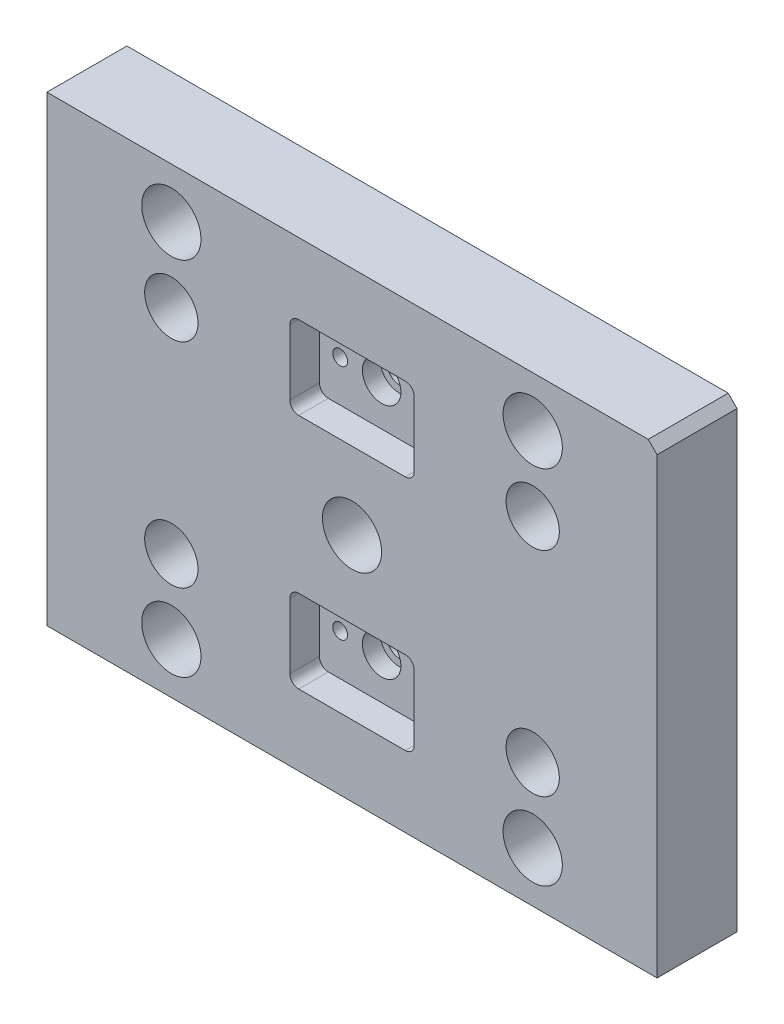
ISO-10303-21;
HEADER;
FILE_DESCRIPTION(('STEP AP214'),'2;1');
FILE_NAME('part.step','',(''),(''),'','','');
FILE_SCHEMA(('AUTOMOTIVE_DESIGN { 1 0 10303 214 1 1 1 1 }'));
ENDSEC;
DATA;
#1=APPLICATION_CONTEXT('core data for automotive mechanical design processes');
#2=APPLICATION_PROTOCOL_DEFINITION('international standard','automotive_design',2000,#1);
#3=PRODUCT_CONTEXT('',#1,'mechanical');
#4=PRODUCT('Part','Part','',(#3));
#5=PRODUCT_RELATED_PRODUCT_CATEGORY('part','',(#4));
#6=PRODUCT_DEFINITION_FORMATION('','',#4);
#7=PRODUCT_DEFINITION_CONTEXT('part definition',#1,'design');
#8=PRODUCT_DEFINITION('design','',#6,#7);
#9=PRODUCT_DEFINITION_SHAPE('','',#8);
#10=(LENGTH_UNIT() NAMED_UNIT(*) SI_UNIT(.MILLI.,.METRE.));
#11=(NAMED_UNIT(*) PLANE_ANGLE_UNIT() SI_UNIT($,.RADIAN.));
#12=(NAMED_UNIT(*) SI_UNIT($,.STERADIAN.) SOLID_ANGLE_UNIT());
#13=UNCERTAINTY_MEASURE_WITH_UNIT(LENGTH_MEASURE(1.E-05),#10,'distance_accuracy_value','');
#14=(GEOMETRIC_REPRESENTATION_CONTEXT(3) GLOBAL_UNCERTAINTY_ASSIGNED_CONTEXT((#13)) GLOBAL_UNIT_ASSIGNED_CONTEXT((#10,
#11,#12)) REPRESENTATION_CONTEXT('',''));
#15=CARTESIAN_POINT('',(0.,0.,0.));
#16=DIRECTION('',(0.,0.,1.));
#17=DIRECTION('',(1.,0.,0.));
#18=AXIS2_PLACEMENT_3D('',#15,#16,#17);
#19=CARTESIAN_POINT('',(0.,-40.,27.));
#20=DIRECTION('',(0.,0.,-1.));
#21=DIRECTION('',(-1.,0.,0.));
#22=AXIS2_PLACEMENT_3D('',#19,#20,#21);
#23=CYLINDRICAL_SURFACE('',#22,4.1);
#24=CARTESIAN_POINT('',(0.,-40.,0.));
#25=DIRECTION('',(0.,0.,-1.));
#26=DIRECTION('',(-1.,0.,0.));
#27=AXIS2_PLACEMENT_3D('',#24,#25,#26);
#28=CIRCLE('',#27,4.1);
#29=CARTESIAN_POINT('',(-4.1,-40.,0.));
#30=VERTEX_POINT('',#29);
#31=EDGE_CURVE('E320',#30,#30,#28,.T.);
#32=ORIENTED_EDGE('',*,*,#31,.T.);
#33=EDGE_LOOP('',(#32));
#34=FACE_BOUND('',#33,.T.);
#35=CARTESIAN_POINT('',(0.,-40.,11.));
#36=DIRECTION('',(0.,0.,1.));
#37=DIRECTION('',(1.,0.,0.));
#38=AXIS2_PLACEMENT_3D('',#35,#36,#37);
#39=CIRCLE('',#38,4.1);
#40=CARTESIAN_POINT('',(4.09999999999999,-40.,11.));
#41=VERTEX_POINT('',#40);
#42=EDGE_CURVE('E45',#41,#41,#39,.F.);
#43=ORIENTED_EDGE('',*,*,#42,.F.);
#44=EDGE_LOOP('',(#43));
#45=FACE_BOUND('',#44,.T.);
#46=ADVANCED_FACE('F41',(#34,#45),#23,.F.);
#47=CARTESIAN_POINT('',(0.,40.,27.));
#48=DIRECTION('',(0.,0.,-1.));
#49=DIRECTION('',(-1.,0.,0.));
#50=AXIS2_PLACEMENT_3D('',#47,#48,#49);
#51=CYLINDRICAL_SURFACE('',#50,4.1);
#52=CARTESIAN_POINT('',(0.,40.,0.));
#53=DIRECTION('',(0.,0.,-1.));
#54=DIRECTION('',(-1.,0.,0.));
#55=AXIS2_PLACEMENT_3D('',#52,#53,#54);
#56=CIRCLE('',#55,4.1);
#57=CARTESIAN_POINT('',(-4.1,40.,0.));
#58=VERTEX_POINT('',#57);
#59=EDGE_CURVE('E315',#58,#58,#56,.T.);
#60=ORIENTED_EDGE('',*,*,#59,.T.);
#61=EDGE_LOOP('',(#60));
#62=FACE_BOUND('',#61,.T.);
#63=CARTESIAN_POINT('',(0.,40.,11.));
#64=DIRECTION('',(0.,0.,1.));
#65=DIRECTION('',(1.,0.,0.));
#66=AXIS2_PLACEMENT_3D('',#63,#64,#65);
#67=CIRCLE('',#66,4.1);
#68=CARTESIAN_POINT('',(4.1,40.,11.));
#69=VERTEX_POINT('',#68);
#70=EDGE_CURVE('E313',#69,#69,#67,.F.);
#71=ORIENTED_EDGE('',*,*,#70,.F.);
#72=EDGE_LOOP('',(#71));
#73=FACE_BOUND('',#72,.T.);
#74=ADVANCED_FACE('F474',(#62,#73),#51,.F.);
#75=CARTESIAN_POINT('',(-103.,-78.,27.));
#76=DIRECTION('',(0.,0.,1.));
#77=DIRECTION('',(1.,0.,0.));
#78=AXIS2_PLACEMENT_3D('',#75,#76,#77);
#79=PLANE('',#78);
#80=CARTESIAN_POINT('',(-61.,-36.,27.));
#81=DIRECTION('',(0.,0.,-1.));
#82=DIRECTION('',(1.,0.,0.));
#83=AXIS2_PLACEMENT_3D('',#80,#81,#82);
#84=CIRCLE('',#83,9.);
#85=CARTESIAN_POINT('',(-52.,-36.,27.));
#86=VERTEX_POINT('',#85);
#87=EDGE_CURVE('E377',#86,#86,#84,.T.);
#88=ORIENTED_EDGE('',*,*,#87,.T.);
#89=EDGE_LOOP('',(#88));
#90=FACE_BOUND('',#89,.T.);
#91=CARTESIAN_POINT('',(-61.,-61.,27.));
#92=DIRECTION('',(0.,0.,-1.));
#93=DIRECTION('',(1.,0.,0.));
#94=AXIS2_PLACEMENT_3D('',#91,#92,#93);
#95=CIRCLE('',#94,10.);
#96=CARTESIAN_POINT('',(-51.,-61.,27.));
#97=VERTEX_POINT('',#96);
#98=EDGE_CURVE('E394',#97,#97,#95,.T.);
#99=ORIENTED_EDGE('',*,*,#98,.T.);
#100=EDGE_LOOP('',(#99));
#101=FACE_BOUND('',#100,.T.);
#102=CARTESIAN_POINT('',(61.,-36.,27.));
#103=DIRECTION('',(0.,0.,1.));
#104=DIRECTION('',(-1.,0.,0.));
#105=AXIS2_PLACEMENT_3D('',#102,#103,#104);
#106=CIRCLE('',#105,9.);
#107=CARTESIAN_POINT('',(70.,-36.,27.));
#108=VERTEX_POINT('',#107);
#109=EDGE_CURVE('E398',#108,#108,#106,.T.);
#110=ORIENTED_EDGE('',*,*,#109,.F.);
#111=EDGE_LOOP('',(#110));
#112=FACE_BOUND('',#111,.T.);
#113=CARTESIAN_POINT('',(61.,-61.,27.));
#114=DIRECTION('',(0.,0.,1.));
#115=DIRECTION('',(-1.,0.,0.));
#116=AXIS2_PLACEMENT_3D('',#113,#114,#115);
#117=CIRCLE('',#116,10.);
#118=CARTESIAN_POINT('',(51.,-61.,27.));
#119=VERTEX_POINT('',#118);
#120=EDGE_CURVE('E407',#119,#119,#117,.T.);
#121=ORIENTED_EDGE('',*,*,#120,.F.);
#122=EDGE_LOOP('',(#121));
#123=FACE_BOUND('',#122,.T.);
#124=DIRECTION('',(0.,1.,0.));
#125=VECTOR('',#124,1.);
#126=CARTESIAN_POINT('',(103.,78.,27.));
#127=LINE('',#126,#125);
#128=CARTESIAN_POINT('',(103.,-78.,27.));
#129=VERTEX_POINT('',#128);
#130=CARTESIAN_POINT('',(103.,75.,27.));
#131=VERTEX_POINT('',#130);
#132=EDGE_CURVE('E196',#129,#131,#127,.T.);
#133=ORIENTED_EDGE('',*,*,#132,.T.);
#134=DIRECTION('',(0.707106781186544,-0.707106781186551,0.));
#135=VECTOR('',#134,1.);
#136=CARTESIAN_POINT('',(76.5000000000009,101.499999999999,27.));
#137=LINE('',#136,#135);
#138=CARTESIAN_POINT('',(100.,78.,27.));
#139=VERTEX_POINT('',#138);
#140=EDGE_CURVE('E280',#131,#139,#137,.F.);
#141=ORIENTED_EDGE('',*,*,#140,.T.);
#142=DIRECTION('',(-1.,0.,0.));
#143=VECTOR('',#142,1.);
#144=CARTESIAN_POINT('',(-103.,78.,27.));
#145=LINE('',#144,#143);
#146=CARTESIAN_POINT('',(-103.,78.,27.));
#147=VERTEX_POINT('',#146);
#148=EDGE_CURVE('E203',#139,#147,#145,.T.);
#149=ORIENTED_EDGE('',*,*,#148,.T.);
#150=DIRECTION('',(0.,-1.,0.));
#151=VECTOR('',#150,1.);
#152=CARTESIAN_POINT('',(-103.,78.,27.));
#153=LINE('',#152,#151);
#154=CARTESIAN_POINT('',(-103.,-78.,27.));
#155=VERTEX_POINT('',#154);
#156=EDGE_CURVE('E197',#147,#155,#153,.T.);
#157=ORIENTED_EDGE('',*,*,#156,.T.);
#158=DIRECTION('',(1.,0.,0.));
#159=VECTOR('',#158,1.);
#160=CARTESIAN_POINT('',(-103.,-78.,27.));
#161=LINE('',#160,#159);
#162=EDGE_CURVE('E185',#155,#129,#161,.T.);
#163=ORIENTED_EDGE('',*,*,#162,.T.);
#164=EDGE_LOOP('',(#133,#141,#149,#157,#163));
#165=FACE_BOUND('',#164,.T.);
#166=CARTESIAN_POINT('',(-61.,61.,27.));
#167=DIRECTION('',(0.,0.,1.));
#168=DIRECTION('',(1.,0.,0.));
#169=AXIS2_PLACEMENT_3D('',#166,#167,#168);
#170=CIRCLE('',#169,10.);
#171=CARTESIAN_POINT('',(-51.,61.,27.));
#172=VERTEX_POINT('',#171);
#173=EDGE_CURVE('E433',#172,#172,#170,.T.);
#174=ORIENTED_EDGE('',*,*,#173,.F.);
#175=EDGE_LOOP('',(#174));
#176=FACE_BOUND('',#175,.T.);
#177=CARTESIAN_POINT('',(-61.,36.,27.));
#178=DIRECTION('',(0.,0.,1.));
#179=DIRECTION('',(1.,0.,0.));
#180=AXIS2_PLACEMENT_3D('',#177,#178,#179);
#181=CIRCLE('',#180,9.);
#182=CARTESIAN_POINT('',(-52.,36.,27.));
#183=VERTEX_POINT('',#182);
#184=EDGE_CURVE('E424',#183,#183,#181,.T.);
#185=ORIENTED_EDGE('',*,*,#184,.F.);
#186=EDGE_LOOP('',(#185));
#187=FACE_BOUND('',#186,.T.);
#188=CARTESIAN_POINT('',(61.,61.,27.));
#189=DIRECTION('',(0.,0.,-1.));
#190=DIRECTION('',(-1.,0.,0.));
#191=AXIS2_PLACEMENT_3D('',#188,#189,#190);
#192=CIRCLE('',#191,10.);
#193=CARTESIAN_POINT('',(51.,61.,27.));
#194=VERTEX_POINT('',#193);
#195=EDGE_CURVE('E420',#194,#194,#192,.T.);
#196=ORIENTED_EDGE('',*,*,#195,.T.);
#197=EDGE_LOOP('',(#196));
#198=FACE_BOUND('',#197,.T.);
#199=CARTESIAN_POINT('',(61.,36.,27.));
#200=DIRECTION('',(0.,0.,-1.));
#201=DIRECTION('',(-1.,0.,0.));
#202=AXIS2_PLACEMENT_3D('',#199,#200,#201);
#203=CIRCLE('',#202,9.);
#204=CARTESIAN_POINT('',(70.,36.,27.));
#205=VERTEX_POINT('',#204);
#206=EDGE_CURVE('E411',#205,#205,#203,.T.);
#207=ORIENTED_EDGE('',*,*,#206,.T.);
#208=EDGE_LOOP('',(#207));
#209=FACE_BOUND('',#208,.T.);
#210=DIRECTION('',(0.,-1.,0.));
#211=VECTOR('',#210,1.);
#212=CARTESIAN_POINT('',(-21.,-26.,27.));
#213=LINE('',#212,#211);
#214=CARTESIAN_POINT('',(-21.,-29.,27.));
#215=VERTEX_POINT('',#214);
#216=CARTESIAN_POINT('',(-21.,-51.,27.));
#217=VERTEX_POINT('',#216);
#218=EDGE_CURVE('E361',#215,#217,#213,.T.);
#219=ORIENTED_EDGE('',*,*,#218,.F.);
#220=CARTESIAN_POINT('',(-18.,-29.,27.));
#221=DIRECTION('',(0.,0.,1.));
#222=DIRECTION('',(1.,0.,0.));
#223=AXIS2_PLACEMENT_3D('',#220,#221,#222);
#224=CIRCLE('',#223,3.);
#225=CARTESIAN_POINT('',(-18.,-26.,27.));
#226=VERTEX_POINT('',#225);
#227=EDGE_CURVE('E271',#215,#226,#224,.F.);
#228=ORIENTED_EDGE('',*,*,#227,.T.);
#229=DIRECTION('',(-1.,0.,0.));
#230=VECTOR('',#229,1.);
#231=CARTESIAN_POINT('',(-21.,-26.,27.));
#232=LINE('',#231,#230);
#233=CARTESIAN_POINT('',(18.,-26.,27.));
#234=VERTEX_POINT('',#233);
#235=EDGE_CURVE('E368',#234,#226,#232,.T.);
#236=ORIENTED_EDGE('',*,*,#235,.F.);
#237=CARTESIAN_POINT('',(18.,-29.,27.));
#238=DIRECTION('',(0.,0.,1.));
#239=DIRECTION('',(1.,0.,0.));
#240=AXIS2_PLACEMENT_3D('',#237,#238,#239);
#241=CIRCLE('',#240,3.);
#242=CARTESIAN_POINT('',(21.,-29.,27.));
#243=VERTEX_POINT('',#242);
#244=EDGE_CURVE('E269',#234,#243,#241,.F.);
#245=ORIENTED_EDGE('',*,*,#244,.T.);
#246=DIRECTION('',(0.,1.,0.));
#247=VECTOR('',#246,1.);
#248=CARTESIAN_POINT('',(21.,-26.,27.));
#249=LINE('',#248,#247);
#250=CARTESIAN_POINT('',(21.,-51.,27.));
#251=VERTEX_POINT('',#250);
#252=EDGE_CURVE('E383',#251,#243,#249,.T.);
#253=ORIENTED_EDGE('',*,*,#252,.F.);
#254=CARTESIAN_POINT('',(18.,-51.,27.));
#255=DIRECTION('',(0.,0.,1.));
#256=DIRECTION('',(1.,0.,0.));
#257=AXIS2_PLACEMENT_3D('',#254,#255,#256);
#258=CIRCLE('',#257,3.);
#259=CARTESIAN_POINT('',(18.,-54.,27.));
#260=VERTEX_POINT('',#259);
#261=EDGE_CURVE('E267',#251,#260,#258,.F.);
#262=ORIENTED_EDGE('',*,*,#261,.T.);
#263=DIRECTION('',(1.,0.,0.));
#264=VECTOR('',#263,1.);
#265=CARTESIAN_POINT('',(-21.,-54.,27.));
#266=LINE('',#265,#264);
#267=CARTESIAN_POINT('',(-18.,-54.,27.));
#268=VERTEX_POINT('',#267);
#269=EDGE_CURVE('E380',#268,#260,#266,.T.);
#270=ORIENTED_EDGE('',*,*,#269,.F.);
#271=CARTESIAN_POINT('',(-18.,-51.,27.));
#272=DIRECTION('',(0.,0.,1.));
#273=DIRECTION('',(1.,0.,0.));
#274=AXIS2_PLACEMENT_3D('',#271,#272,#273);
#275=CIRCLE('',#274,3.);
#276=EDGE_CURVE('E265',#268,#217,#275,.F.);
#277=ORIENTED_EDGE('',*,*,#276,.T.);
#278=EDGE_LOOP('',(#219,#228,#236,#245,#253,#262,#270,#277));
#279=FACE_BOUND('',#278,.T.);
#280=CARTESIAN_POINT('',(0.,0.,27.));
#281=DIRECTION('',(0.,0.,1.));
#282=DIRECTION('',(1.,0.,0.));
#283=AXIS2_PLACEMENT_3D('',#280,#281,#282);
#284=CIRCLE('',#283,10.);
#285=CARTESIAN_POINT('',(10.,0.,27.));
#286=VERTEX_POINT('',#285);
#287=EDGE_CURVE('E349',#286,#286,#284,.T.);
#288=ORIENTED_EDGE('',*,*,#287,.F.);
#289=EDGE_LOOP('',(#288));
#290=FACE_BOUND('',#289,.T.);
#291=DIRECTION('',(0.,-1.,0.));
#292=VECTOR('',#291,1.);
#293=CARTESIAN_POINT('',(21.,26.,27.));
#294=LINE('',#293,#292);
#295=CARTESIAN_POINT('',(21.,51.,27.));
#296=VERTEX_POINT('',#295);
#297=CARTESIAN_POINT('',(21.,29.,27.));
#298=VERTEX_POINT('',#297);
#299=EDGE_CURVE('E354',#296,#298,#294,.T.);
#300=ORIENTED_EDGE('',*,*,#299,.T.);
#301=CARTESIAN_POINT('',(18.,29.,27.));
#302=DIRECTION('',(0.,0.,1.));
#303=DIRECTION('',(1.,0.,0.));
#304=AXIS2_PLACEMENT_3D('',#301,#302,#303);
#305=CIRCLE('',#304,3.);
#306=CARTESIAN_POINT('',(18.,26.,27.));
#307=VERTEX_POINT('',#306);
#308=EDGE_CURVE('E50',#298,#307,#305,.F.);
#309=ORIENTED_EDGE('',*,*,#308,.T.);
#310=DIRECTION('',(-1.,0.,0.));
#311=VECTOR('',#310,1.);
#312=CARTESIAN_POINT('',(-21.,26.,27.));
#313=LINE('',#312,#311);
#314=CARTESIAN_POINT('',(-18.,26.,27.));
#315=VERTEX_POINT('',#314);
#316=EDGE_CURVE('E352',#307,#315,#313,.T.);
#317=ORIENTED_EDGE('',*,*,#316,.T.);
#318=CARTESIAN_POINT('',(-18.,29.,27.));
#319=DIRECTION('',(0.,0.,1.));
#320=DIRECTION('',(1.,0.,0.));
#321=AXIS2_PLACEMENT_3D('',#318,#319,#320);
#322=CIRCLE('',#321,3.);
#323=CARTESIAN_POINT('',(-21.,29.,27.));
#324=VERTEX_POINT('',#323);
#325=EDGE_CURVE('E11',#315,#324,#322,.F.);
#326=ORIENTED_EDGE('',*,*,#325,.T.);
#327=DIRECTION('',(0.,1.,0.));
#328=VECTOR('',#327,1.);
#329=CARTESIAN_POINT('',(-21.,26.,27.));
#330=LINE('',#329,#328);
#331=CARTESIAN_POINT('',(-21.,51.,27.));
#332=VERTEX_POINT('',#331);
#333=EDGE_CURVE('E335',#324,#332,#330,.T.);
#334=ORIENTED_EDGE('',*,*,#333,.T.);
#335=CARTESIAN_POINT('',(-18.,51.,27.));
#336=DIRECTION('',(0.,0.,1.));
#337=DIRECTION('',(1.,0.,0.));
#338=AXIS2_PLACEMENT_3D('',#335,#336,#337);
#339=CIRCLE('',#338,3.);
#340=CARTESIAN_POINT('',(-18.,54.,27.));
#341=VERTEX_POINT('',#340);
#342=EDGE_CURVE('E309',#332,#341,#339,.F.);
#343=ORIENTED_EDGE('',*,*,#342,.T.);
#344=DIRECTION('',(1.,0.,0.));
#345=VECTOR('',#344,1.);
#346=CARTESIAN_POINT('',(-21.,54.,27.));
#347=LINE('',#346,#345);
#348=CARTESIAN_POINT('',(18.,54.,27.));
#349=VERTEX_POINT('',#348);
#350=EDGE_CURVE('E340',#341,#349,#347,.T.);
#351=ORIENTED_EDGE('',*,*,#350,.T.);
#352=CARTESIAN_POINT('',(18.,51.,27.));
#353=DIRECTION('',(0.,0.,1.));
#354=DIRECTION('',(1.,0.,0.));
#355=AXIS2_PLACEMENT_3D('',#352,#353,#354);
#356=CIRCLE('',#355,3.);
#357=EDGE_CURVE('E311',#349,#296,#356,.F.);
#358=ORIENTED_EDGE('',*,*,#357,.T.);
#359=EDGE_LOOP('',(#300,#309,#317,#326,#334,#343,#351,#358));
#360=FACE_BOUND('',#359,.T.);
#361=ADVANCED_FACE('F200',(#90,#101,#112,#123,#165,#176,#187,#198,#209,#279,#290,#360),#79,.T.);
#362=CARTESIAN_POINT('',(-61.,-36.,0.));
#363=DIRECTION('',(0.,0.,1.));
#364=DIRECTION('',(1.,0.,0.));
#365=AXIS2_PLACEMENT_3D('',#362,#363,#364);
#366=CYLINDRICAL_SURFACE('',#365,5.25);
#367=CARTESIAN_POINT('',(-61.,-36.,0.));
#368=DIRECTION('',(0.,0.,-1.));
#369=DIRECTION('',(1.,0.,0.));
#370=AXIS2_PLACEMENT_3D('',#367,#368,#369);
#371=CIRCLE('',#370,5.25);
#372=CARTESIAN_POINT('',(-55.75,-36.,0.));
#373=VERTEX_POINT('',#372);
#374=EDGE_CURVE('E237',#373,#373,#371,.T.);
#375=ORIENTED_EDGE('',*,*,#374,.T.);
#376=EDGE_LOOP('',(#375));
#377=FACE_BOUND('',#376,.T.);
#378=CARTESIAN_POINT('',(-61.,-36.,14.));
#379=DIRECTION('',(0.,0.,1.));
#380=DIRECTION('',(1.,0.,0.));
#381=AXIS2_PLACEMENT_3D('',#378,#379,#380);
#382=CIRCLE('',#381,5.25);
#383=CARTESIAN_POINT('',(-55.75,-36.,14.));
#384=VERTEX_POINT('',#383);
#385=EDGE_CURVE('E235',#384,#384,#382,.T.);
#386=ORIENTED_EDGE('',*,*,#385,.T.);
#387=EDGE_LOOP('',(#386));
#388=FACE_BOUND('',#387,.T.);
#389=ADVANCED_FACE('F541',(#377,#388),#366,.F.);
#390=CARTESIAN_POINT('',(-103.,-78.,0.));
#391=DIRECTION('',(0.,0.,1.));
#392=DIRECTION('',(1.,0.,0.));
#393=AXIS2_PLACEMENT_3D('',#390,#391,#392);
#394=PLANE('',#393);
#395=CARTESIAN_POINT('',(14.,-40.,0.));
#396=DIRECTION('',(0.,0.,1.));
#397=DIRECTION('',(1.,0.,0.));
#398=AXIS2_PLACEMENT_3D('',#395,#396,#397);
#399=CIRCLE('',#398,2.5);
#400=CARTESIAN_POINT('',(16.5,-40.,0.));
#401=VERTEX_POINT('',#400);
#402=EDGE_CURVE('E600',#401,#401,#399,.T.);
#403=ORIENTED_EDGE('',*,*,#402,.T.);
#404=EDGE_LOOP('',(#403));
#405=FACE_BOUND('',#404,.T.);
#406=CARTESIAN_POINT('',(-14.,-40.,0.));
#407=DIRECTION('',(0.,0.,1.));
#408=DIRECTION('',(1.,0.,0.));
#409=AXIS2_PLACEMENT_3D('',#406,#407,#408);
#410=CIRCLE('',#409,2.5);
#411=CARTESIAN_POINT('',(-11.5,-40.,0.));
#412=VERTEX_POINT('',#411);
#413=EDGE_CURVE('E604',#412,#412,#410,.T.);
#414=ORIENTED_EDGE('',*,*,#413,.T.);
#415=EDGE_LOOP('',(#414));
#416=FACE_BOUND('',#415,.T.);
#417=CARTESIAN_POINT('',(14.,40.,0.));
#418=DIRECTION('',(0.,0.,1.));
#419=DIRECTION('',(1.,0.,0.));
#420=AXIS2_PLACEMENT_3D('',#417,#418,#419);
#421=CIRCLE('',#420,2.5);
#422=CARTESIAN_POINT('',(16.5,40.,0.));
#423=VERTEX_POINT('',#422);
#424=EDGE_CURVE('E608',#423,#423,#421,.T.);
#425=ORIENTED_EDGE('',*,*,#424,.T.);
#426=EDGE_LOOP('',(#425));
#427=FACE_BOUND('',#426,.T.);
#428=CARTESIAN_POINT('',(-14.,40.,0.));
#429=DIRECTION('',(0.,0.,1.));
#430=DIRECTION('',(1.,0.,0.));
#431=AXIS2_PLACEMENT_3D('',#428,#429,#430);
#432=CIRCLE('',#431,2.5);
#433=CARTESIAN_POINT('',(-11.5,40.,0.));
#434=VERTEX_POINT('',#433);
#435=EDGE_CURVE('E612',#434,#434,#432,.T.);
#436=ORIENTED_EDGE('',*,*,#435,.T.);
#437=EDGE_LOOP('',(#436));
#438=FACE_BOUND('',#437,.T.);
#439=ORIENTED_EDGE('',*,*,#59,.F.);
#440=EDGE_LOOP('',(#439));
#441=FACE_BOUND('',#440,.T.);
#442=ORIENTED_EDGE('',*,*,#31,.F.);
#443=EDGE_LOOP('',(#442));
#444=FACE_BOUND('',#443,.T.);
#445=CARTESIAN_POINT('',(0.,0.,0.));
#446=DIRECTION('',(0.,0.,1.));
#447=DIRECTION('',(1.,0.,0.));
#448=AXIS2_PLACEMENT_3D('',#445,#446,#447);
#449=CIRCLE('',#448,10.);
#450=CARTESIAN_POINT('',(10.,0.,0.));
#451=VERTEX_POINT('',#450);
#452=EDGE_CURVE('E358',#451,#451,#449,.T.);
#453=ORIENTED_EDGE('',*,*,#452,.T.);
#454=EDGE_LOOP('',(#453));
#455=FACE_BOUND('',#454,.T.);
#456=CARTESIAN_POINT('',(-61.,-61.,0.));
#457=DIRECTION('',(0.,0.,-1.));
#458=DIRECTION('',(1.,0.,0.));
#459=AXIS2_PLACEMENT_3D('',#456,#457,#458);
#460=CIRCLE('',#459,10.);
#461=CARTESIAN_POINT('',(-51.,-61.,0.));
#462=VERTEX_POINT('',#461);
#463=EDGE_CURVE('E395',#462,#462,#460,.T.);
#464=ORIENTED_EDGE('',*,*,#463,.F.);
#465=EDGE_LOOP('',(#464));
#466=FACE_BOUND('',#465,.T.);
#467=CARTESIAN_POINT('',(61.,-36.,0.));
#468=DIRECTION('',(0.,0.,1.));
#469=DIRECTION('',(-1.,0.,0.));
#470=AXIS2_PLACEMENT_3D('',#467,#468,#469);
#471=CIRCLE('',#470,5.25);
#472=CARTESIAN_POINT('',(55.75,-36.,0.));
#473=VERTEX_POINT('',#472);
#474=EDGE_CURVE('E233',#473,#473,#471,.T.);
#475=ORIENTED_EDGE('',*,*,#474,.T.);
#476=EDGE_LOOP('',(#475));
#477=FACE_BOUND('',#476,.T.);
#478=CARTESIAN_POINT('',(61.,-61.,0.));
#479=DIRECTION('',(0.,0.,1.));
#480=DIRECTION('',(-1.,0.,0.));
#481=AXIS2_PLACEMENT_3D('',#478,#479,#480);
#482=CIRCLE('',#481,10.);
#483=CARTESIAN_POINT('',(51.,-61.,0.));
#484=VERTEX_POINT('',#483);
#485=EDGE_CURVE('E408',#484,#484,#482,.T.);
#486=ORIENTED_EDGE('',*,*,#485,.T.);
#487=EDGE_LOOP('',(#486));
#488=FACE_BOUND('',#487,.T.);
#489=CARTESIAN_POINT('',(61.,61.,0.));
#490=DIRECTION('',(0.,0.,-1.));
#491=DIRECTION('',(-1.,0.,0.));
#492=AXIS2_PLACEMENT_3D('',#489,#490,#491);
#493=CIRCLE('',#492,10.);
#494=CARTESIAN_POINT('',(51.,61.,0.));
#495=VERTEX_POINT('',#494);
#496=EDGE_CURVE('E421',#495,#495,#493,.T.);
#497=ORIENTED_EDGE('',*,*,#496,.F.);
#498=EDGE_LOOP('',(#497));
#499=FACE_BOUND('',#498,.T.);
#500=CARTESIAN_POINT('',(-61.,36.,0.));
#501=DIRECTION('',(0.,0.,1.));
#502=DIRECTION('',(1.,0.,0.));
#503=AXIS2_PLACEMENT_3D('',#500,#501,#502);
#504=CIRCLE('',#503,5.25);
#505=CARTESIAN_POINT('',(-55.75,36.,0.));
#506=VERTEX_POINT('',#505);
#507=EDGE_CURVE('E223',#506,#506,#504,.T.);
#508=ORIENTED_EDGE('',*,*,#507,.T.);
#509=EDGE_LOOP('',(#508));
#510=FACE_BOUND('',#509,.T.);
#511=CARTESIAN_POINT('',(-61.,61.,0.));
#512=DIRECTION('',(0.,0.,1.));
#513=DIRECTION('',(1.,0.,0.));
#514=AXIS2_PLACEMENT_3D('',#511,#512,#513);
#515=CIRCLE('',#514,10.);
#516=CARTESIAN_POINT('',(-51.,61.,0.));
#517=VERTEX_POINT('',#516);
#518=EDGE_CURVE('E434',#517,#517,#515,.T.);
#519=ORIENTED_EDGE('',*,*,#518,.T.);
#520=EDGE_LOOP('',(#519));
#521=FACE_BOUND('',#520,.T.);
#522=DIRECTION('',(-1.,0.,0.));
#523=VECTOR('',#522,1.);
#524=CARTESIAN_POINT('',(-103.,78.,0.));
#525=LINE('',#524,#523);
#526=CARTESIAN_POINT('',(100.,78.,0.));
#527=VERTEX_POINT('',#526);
#528=CARTESIAN_POINT('',(-103.,78.,0.));
#529=VERTEX_POINT('',#528);
#530=EDGE_CURVE('E207',#527,#529,#525,.T.);
#531=ORIENTED_EDGE('',*,*,#530,.F.);
#532=DIRECTION('',(-0.707106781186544,0.707106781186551,0.));
#533=VECTOR('',#532,1.);
#534=CARTESIAN_POINT('',(100.,78.,0.));
#535=LINE('',#534,#533);
#536=CARTESIAN_POINT('',(103.,75.,0.));
#537=VERTEX_POINT('',#536);
#538=EDGE_CURVE('E276',#527,#537,#535,.F.);
#539=ORIENTED_EDGE('',*,*,#538,.T.);
#540=DIRECTION('',(0.,1.,0.));
#541=VECTOR('',#540,1.);
#542=CARTESIAN_POINT('',(103.,78.,0.));
#543=LINE('',#542,#541);
#544=CARTESIAN_POINT('',(103.,-78.,0.));
#545=VERTEX_POINT('',#544);
#546=EDGE_CURVE('E444',#545,#537,#543,.T.);
#547=ORIENTED_EDGE('',*,*,#546,.F.);
#548=DIRECTION('',(1.,0.,0.));
#549=VECTOR('',#548,1.);
#550=CARTESIAN_POINT('',(-103.,-78.,0.));
#551=LINE('',#550,#549);
#552=CARTESIAN_POINT('',(-103.,-78.,0.));
#553=VERTEX_POINT('',#552);
#554=EDGE_CURVE('E442',#553,#545,#551,.T.);
#555=ORIENTED_EDGE('',*,*,#554,.F.);
#556=DIRECTION('',(0.,-1.,0.));
#557=VECTOR('',#556,1.);
#558=CARTESIAN_POINT('',(-103.,78.,0.));
#559=LINE('',#558,#557);
#560=EDGE_CURVE('E211',#529,#553,#559,.T.);
#561=ORIENTED_EDGE('',*,*,#560,.F.);
#562=EDGE_LOOP('',(#531,#539,#547,#555,#561));
#563=FACE_BOUND('',#562,.T.);
#564=CARTESIAN_POINT('',(61.,36.,0.));
#565=DIRECTION('',(0.,0.,-1.));
#566=DIRECTION('',(-1.,0.,0.));
#567=AXIS2_PLACEMENT_3D('',#564,#565,#566);
#568=CIRCLE('',#567,5.25);
#569=CARTESIAN_POINT('',(55.75,36.,0.));
#570=VERTEX_POINT('',#569);
#571=EDGE_CURVE('E228',#570,#570,#568,.T.);
#572=ORIENTED_EDGE('',*,*,#571,.F.);
#573=EDGE_LOOP('',(#572));
#574=FACE_BOUND('',#573,.T.);
#575=ORIENTED_EDGE('',*,*,#374,.F.);
#576=EDGE_LOOP('',(#575));
#577=FACE_BOUND('',#576,.T.);
#578=ADVANCED_FACE('F450',(#405,#416,#427,#438,#441,#444,#455,#466,#477,#488,#499,#510,#521,
#563,#574,#577),#394,.F.);
#579=CARTESIAN_POINT('',(61.,-36.,0.));
#580=DIRECTION('',(0.,0.,1.));
#581=DIRECTION('',(1.,0.,0.));
#582=AXIS2_PLACEMENT_3D('',#579,#580,#581);
#583=CYLINDRICAL_SURFACE('',#582,5.25);
#584=ORIENTED_EDGE('',*,*,#474,.F.);
#585=EDGE_LOOP('',(#584));
#586=FACE_BOUND('',#585,.T.);
#587=CARTESIAN_POINT('',(61.,-36.,14.));
#588=DIRECTION('',(0.,0.,1.));
#589=DIRECTION('',(1.,0.,0.));
#590=AXIS2_PLACEMENT_3D('',#587,#588,#589);
#591=CIRCLE('',#590,5.25);
#592=CARTESIAN_POINT('',(66.25,-36.,14.));
#593=VERTEX_POINT('',#592);
#594=EDGE_CURVE('E230',#593,#593,#591,.F.);
#595=ORIENTED_EDGE('',*,*,#594,.F.);
#596=EDGE_LOOP('',(#595));
#597=FACE_BOUND('',#596,.T.);
#598=ADVANCED_FACE('F557',(#586,#597),#583,.F.);
#599=CARTESIAN_POINT('',(61.,36.,0.));
#600=DIRECTION('',(0.,0.,1.));
#601=DIRECTION('',(1.,0.,0.));
#602=AXIS2_PLACEMENT_3D('',#599,#600,#601);
#603=CYLINDRICAL_SURFACE('',#602,5.25);
#604=ORIENTED_EDGE('',*,*,#571,.T.);
#605=EDGE_LOOP('',(#604));
#606=FACE_BOUND('',#605,.T.);
#607=CARTESIAN_POINT('',(61.,36.,14.));
#608=DIRECTION('',(0.,0.,1.));
#609=DIRECTION('',(1.,0.,0.));
#610=AXIS2_PLACEMENT_3D('',#607,#608,#609);
#611=CIRCLE('',#610,5.25);
#612=CARTESIAN_POINT('',(66.25,36.,14.));
#613=VERTEX_POINT('',#612);
#614=EDGE_CURVE('E225',#613,#613,#611,.T.);
#615=ORIENTED_EDGE('',*,*,#614,.T.);
#616=EDGE_LOOP('',(#615));
#617=FACE_BOUND('',#616,.T.);
#618=ADVANCED_FACE('F560',(#606,#617),#603,.F.);
#619=CARTESIAN_POINT('',(-61.,36.,0.));
#620=DIRECTION('',(0.,0.,1.));
#621=DIRECTION('',(1.,0.,0.));
#622=AXIS2_PLACEMENT_3D('',#619,#620,#621);
#623=CYLINDRICAL_SURFACE('',#622,5.25);
#624=ORIENTED_EDGE('',*,*,#507,.F.);
#625=EDGE_LOOP('',(#624));
#626=FACE_BOUND('',#625,.T.);
#627=CARTESIAN_POINT('',(-61.,36.,14.));
#628=DIRECTION('',(0.,0.,1.));
#629=DIRECTION('',(1.,0.,0.));
#630=AXIS2_PLACEMENT_3D('',#627,#628,#629);
#631=CIRCLE('',#630,5.25);
#632=CARTESIAN_POINT('',(-55.75,36.,14.));
#633=VERTEX_POINT('',#632);
#634=EDGE_CURVE('E220',#633,#633,#631,.F.);
#635=ORIENTED_EDGE('',*,*,#634,.F.);
#636=EDGE_LOOP('',(#635));
#637=FACE_BOUND('',#636,.T.);
#638=ADVANCED_FACE('F576',(#626,#637),#623,.F.);
#639=CARTESIAN_POINT('',(-103.,78.,27.));
#640=DIRECTION('',(1.,0.,0.));
#641=DIRECTION('',(0.,1.,0.));
#642=AXIS2_PLACEMENT_3D('',#639,#640,#641);
#643=PLANE('',#642);
#644=ORIENTED_EDGE('',*,*,#560,.T.);
#645=DIRECTION('',(0.,0.,-1.));
#646=VECTOR('',#645,1.);
#647=CARTESIAN_POINT('',(-103.,-78.,27.));
#648=LINE('',#647,#646);
#649=EDGE_CURVE('E189',#155,#553,#648,.T.);
#650=ORIENTED_EDGE('',*,*,#649,.F.);
#651=ORIENTED_EDGE('',*,*,#156,.F.);
#652=DIRECTION('',(0.,0.,-1.));
#653=VECTOR('',#652,1.);
#654=CARTESIAN_POINT('',(-103.,78.,27.));
#655=LINE('',#654,#653);
#656=EDGE_CURVE('E216',#147,#529,#655,.T.);
#657=ORIENTED_EDGE('',*,*,#656,.T.);
#658=EDGE_LOOP('',(#644,#650,#651,#657));
#659=FACE_BOUND('',#658,.T.);
#660=ADVANCED_FACE('F209',(#659),#643,.F.);
#661=CARTESIAN_POINT('',(-103.,-78.,27.));
#662=DIRECTION('',(0.,1.,0.));
#663=DIRECTION('',(0.,0.,1.));
#664=AXIS2_PLACEMENT_3D('',#661,#662,#663);
#665=PLANE('',#664);
#666=ORIENTED_EDGE('',*,*,#554,.T.);
#667=DIRECTION('',(0.,0.,-1.));
#668=VECTOR('',#667,1.);
#669=CARTESIAN_POINT('',(103.,-78.,27.));
#670=LINE('',#669,#668);
#671=EDGE_CURVE('E192',#129,#545,#670,.T.);
#672=ORIENTED_EDGE('',*,*,#671,.F.);
#673=ORIENTED_EDGE('',*,*,#162,.F.);
#674=ORIENTED_EDGE('',*,*,#649,.T.);
#675=EDGE_LOOP('',(#666,#672,#673,#674));
#676=FACE_BOUND('',#675,.T.);
#677=ADVANCED_FACE('F187',(#676),#665,.F.);
#678=CARTESIAN_POINT('',(103.,78.,27.));
#679=DIRECTION('',(-1.,0.,0.));
#680=DIRECTION('',(0.,-1.,0.));
#681=AXIS2_PLACEMENT_3D('',#678,#679,#680);
#682=PLANE('',#681);
#683=ORIENTED_EDGE('',*,*,#546,.T.);
#684=DIRECTION('',(0.,0.,1.));
#685=VECTOR('',#684,1.);
#686=CARTESIAN_POINT('',(103.,75.,27.));
#687=LINE('',#686,#685);
#688=EDGE_CURVE('E278',#537,#131,#687,.T.);
#689=ORIENTED_EDGE('',*,*,#688,.T.);
#690=ORIENTED_EDGE('',*,*,#132,.F.);
#691=ORIENTED_EDGE('',*,*,#671,.T.);
#692=EDGE_LOOP('',(#683,#689,#690,#691));
#693=FACE_BOUND('',#692,.T.);
#694=ADVANCED_FACE('F454',(#693),#682,.F.);
#695=CARTESIAN_POINT('',(-103.,78.,27.));
#696=DIRECTION('',(0.,-1.,0.));
#697=DIRECTION('',(0.,0.,-1.));
#698=AXIS2_PLACEMENT_3D('',#695,#696,#697);
#699=PLANE('',#698);
#700=ORIENTED_EDGE('',*,*,#148,.F.);
#701=DIRECTION('',(0.,0.,-1.));
#702=VECTOR('',#701,1.);
#703=CARTESIAN_POINT('',(100.,78.,27.));
#704=LINE('',#703,#702);
#705=EDGE_CURVE('E273',#139,#527,#704,.T.);
#706=ORIENTED_EDGE('',*,*,#705,.T.);
#707=ORIENTED_EDGE('',*,*,#530,.T.);
#708=ORIENTED_EDGE('',*,*,#656,.F.);
#709=EDGE_LOOP('',(#700,#706,#707,#708));
#710=FACE_BOUND('',#709,.T.);
#711=ADVANCED_FACE('F460',(#710),#699,.F.);
#712=CARTESIAN_POINT('',(-61.,61.,0.));
#713=DIRECTION('',(0.,0.,1.));
#714=DIRECTION('',(1.,0.,0.));
#715=AXIS2_PLACEMENT_3D('',#712,#713,#714);
#716=CYLINDRICAL_SURFACE('',#715,10.);
#717=ORIENTED_EDGE('',*,*,#518,.F.);
#718=EDGE_LOOP('',(#717));
#719=FACE_BOUND('',#718,.T.);
#720=ORIENTED_EDGE('',*,*,#173,.T.);
#721=EDGE_LOOP('',(#720));
#722=FACE_BOUND('',#721,.T.);
#723=ADVANCED_FACE('F462',(#719,#722),#716,.F.);
#724=CARTESIAN_POINT('',(-61.,36.,14.));
#725=DIRECTION('',(0.,0.,1.));
#726=DIRECTION('',(1.,0.,0.));
#727=AXIS2_PLACEMENT_3D('',#724,#725,#726);
#728=PLANE('',#727);
#729=CARTESIAN_POINT('',(-61.,36.,14.));
#730=DIRECTION('',(0.,0.,1.));
#731=DIRECTION('',(1.,0.,0.));
#732=AXIS2_PLACEMENT_3D('',#729,#730,#731);
#733=CIRCLE('',#732,9.);
#734=CARTESIAN_POINT('',(-52.,36.,14.));
#735=VERTEX_POINT('',#734);
#736=EDGE_CURVE('E224',#735,#735,#733,.T.);
#737=ORIENTED_EDGE('',*,*,#736,.T.);
#738=EDGE_LOOP('',(#737));
#739=FACE_BOUND('',#738,.T.);
#740=ORIENTED_EDGE('',*,*,#634,.T.);
#741=EDGE_LOOP('',(#740));
#742=FACE_BOUND('',#741,.T.);
#743=ADVANCED_FACE('F468',(#739,#742),#728,.T.);
#744=CARTESIAN_POINT('',(-61.,36.,14.));
#745=DIRECTION('',(0.,0.,1.));
#746=DIRECTION('',(1.,0.,0.));
#747=AXIS2_PLACEMENT_3D('',#744,#745,#746);
#748=CYLINDRICAL_SURFACE('',#747,9.);
#749=CARTESIAN_POINT('',(-52.,36.,14.));
#750=CARTESIAN_POINT('',(-52.,36.,14.1354166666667));
#751=CARTESIAN_POINT('',(-52.,36.,14.2708333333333));
#752=CARTESIAN_POINT('',(-52.,36.,14.5416666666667));
#753=CARTESIAN_POINT('',(-52.,36.,14.6770833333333));
#754=CARTESIAN_POINT('',(-52.,36.,14.9479166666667));
#755=CARTESIAN_POINT('',(-52.,36.,15.0833333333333));
#756=CARTESIAN_POINT('',(-52.,36.,15.3541666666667));
#757=CARTESIAN_POINT('',(-52.,36.,15.4895833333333));
#758=CARTESIAN_POINT('',(-52.,36.,15.7604166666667));
#759=CARTESIAN_POINT('',(-52.,36.,15.8958333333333));
#760=CARTESIAN_POINT('',(-52.,36.,16.1666666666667));
#761=CARTESIAN_POINT('',(-52.,36.,16.3020833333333));
#762=CARTESIAN_POINT('',(-52.,36.,16.5729166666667));
#763=CARTESIAN_POINT('',(-52.,36.,16.7083333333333));
#764=CARTESIAN_POINT('',(-52.,36.,16.9791666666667));
#765=CARTESIAN_POINT('',(-52.,36.,17.1145833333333));
#766=CARTESIAN_POINT('',(-52.,36.,17.3854166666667));
#767=CARTESIAN_POINT('',(-52.,36.,17.5208333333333));
#768=CARTESIAN_POINT('',(-52.,36.,17.7916666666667));
#769=CARTESIAN_POINT('',(-52.,36.,17.9270833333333));
#770=CARTESIAN_POINT('',(-52.,36.,18.1979166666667));
#771=CARTESIAN_POINT('',(-52.,36.,18.3333333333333));
#772=CARTESIAN_POINT('',(-52.,36.,18.6041666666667));
#773=CARTESIAN_POINT('',(-52.,36.,18.7395833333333));
#774=CARTESIAN_POINT('',(-52.,36.,19.0104166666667));
#775=CARTESIAN_POINT('',(-52.,36.,19.1458333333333));
#776=CARTESIAN_POINT('',(-52.,36.,19.4166666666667));
#777=CARTESIAN_POINT('',(-52.,36.,19.5520833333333));
#778=CARTESIAN_POINT('',(-52.,36.,19.8229166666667));
#779=CARTESIAN_POINT('',(-52.,36.,19.9583333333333));
#780=CARTESIAN_POINT('',(-52.,36.,20.2291666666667));
#781=CARTESIAN_POINT('',(-52.,36.,20.3645833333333));
#782=CARTESIAN_POINT('',(-52.,36.,20.6354166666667));
#783=CARTESIAN_POINT('',(-52.,36.,20.7708333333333));
#784=CARTESIAN_POINT('',(-52.,36.,21.0416666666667));
#785=CARTESIAN_POINT('',(-52.,36.,21.1770833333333));
#786=CARTESIAN_POINT('',(-52.,36.,21.4479166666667));
#787=CARTESIAN_POINT('',(-52.,36.,21.5833333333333));
#788=CARTESIAN_POINT('',(-52.,36.,21.8541666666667));
#789=CARTESIAN_POINT('',(-52.,36.,21.9895833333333));
#790=CARTESIAN_POINT('',(-52.,36.,22.2604166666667));
#791=CARTESIAN_POINT('',(-52.,36.,22.3958333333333));
#792=CARTESIAN_POINT('',(-52.,36.,22.6666666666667));
#793=CARTESIAN_POINT('',(-52.,36.,22.8020833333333));
#794=CARTESIAN_POINT('',(-52.,36.,23.0729166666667));
#795=CARTESIAN_POINT('',(-52.,36.,23.2083333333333));
#796=CARTESIAN_POINT('',(-52.,36.,23.4791666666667));
#797=CARTESIAN_POINT('',(-52.,36.,23.6145833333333));
#798=CARTESIAN_POINT('',(-52.,36.,23.8854166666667));
#799=CARTESIAN_POINT('',(-52.,36.,24.0208333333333));
#800=CARTESIAN_POINT('',(-52.,36.,24.2916666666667));
#801=CARTESIAN_POINT('',(-52.,36.,24.4270833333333));
#802=CARTESIAN_POINT('',(-52.,36.,24.6979166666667));
#803=CARTESIAN_POINT('',(-52.,36.,24.8333333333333));
#804=CARTESIAN_POINT('',(-52.,36.,25.1041666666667));
#805=CARTESIAN_POINT('',(-52.,36.,25.2395833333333));
#806=CARTESIAN_POINT('',(-52.,36.,25.5104166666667));
#807=CARTESIAN_POINT('',(-52.,36.,25.6458333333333));
#808=CARTESIAN_POINT('',(-52.,36.,25.9166666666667));
#809=CARTESIAN_POINT('',(-52.,36.,26.0520833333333));
#810=CARTESIAN_POINT('',(-52.,36.,26.3229166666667));
#811=CARTESIAN_POINT('',(-52.,36.,26.4583333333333));
#812=CARTESIAN_POINT('',(-52.,36.,26.7291666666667));
#813=CARTESIAN_POINT('',(-52.,36.,26.8645833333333));
#814=CARTESIAN_POINT('',(-52.,36.,27.));
#815=B_SPLINE_CURVE_WITH_KNOTS('',3,(#749,#750,#751,#752,#753,#754,#755,#756,#757,#758,#759,
#760,#761,#762,#763,#764,#765,#766,#767,#768,#769,#770,#771,#772,#773,#774,#775,#776,#777,#778,
#779,#780,#781,#782,#783,#784,#785,#786,#787,#788,#789,#790,#791,#792,#793,#794,#795,#796,#797,
#798,#799,#800,#801,#802,#803,#804,#805,#806,#807,#808,#809,#810,#811,#812,#813,#814),
.UNSPECIFIED.,.F.,.F.,(4,2,2,2,2,2,2,2,2,2,2,2,2,2,2,2,2,2,2,2,2,2,2,2,2,2,2,2,2,2,2,2,4),(0.,
0.406249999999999,0.812499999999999,1.21875,1.625,2.03125,2.4375,2.84375,3.25,3.65625,4.0625,
4.46875,4.875,5.28125,5.6875,6.09375,6.5,6.90625,7.3125,7.71875,8.125,8.53125,8.9375,9.34375,
9.75,10.15625,10.5625,10.96875,11.375,11.78125,12.1875,12.59375,13.),.UNSPECIFIED.);
#816=EDGE_CURVE('BSEAM580',#735,#183,#815,.T.);
#817=ORIENTED_EDGE('',*,*,#736,.F.);
#818=ORIENTED_EDGE('',*,*,#184,.T.);
#819=ORIENTED_EDGE('',*,*,#816,.T.);
#820=ORIENTED_EDGE('',*,*,#816,.F.);
#821=EDGE_LOOP('',(#817,#819,#818,#820));
#822=FACE_BOUND('',#821,.T.);
#823=ADVANCED_FACE('F580',(#822),#748,.F.);
#824=CARTESIAN_POINT('',(61.,61.,0.));
#825=DIRECTION('',(0.,0.,1.));
#826=DIRECTION('',(1.,0.,0.));
#827=AXIS2_PLACEMENT_3D('',#824,#825,#826);
#828=CYLINDRICAL_SURFACE('',#827,10.);
#829=ORIENTED_EDGE('',*,*,#496,.T.);
#830=EDGE_LOOP('',(#829));
#831=FACE_BOUND('',#830,.T.);
#832=ORIENTED_EDGE('',*,*,#195,.F.);
#833=EDGE_LOOP('',(#832));
#834=FACE_BOUND('',#833,.T.);
#835=ADVANCED_FACE('F572',(#831,#834),#828,.F.);
#836=CARTESIAN_POINT('',(61.,36.,14.));
#837=DIRECTION('',(0.,0.,1.));
#838=DIRECTION('',(1.,0.,0.));
#839=AXIS2_PLACEMENT_3D('',#836,#837,#838);
#840=CYLINDRICAL_SURFACE('',#839,9.);
#841=CARTESIAN_POINT('',(61.,36.,14.));
#842=DIRECTION('',(0.,0.,-1.));
#843=DIRECTION('',(-1.,0.,0.));
#844=AXIS2_PLACEMENT_3D('',#841,#842,#843);
#845=CIRCLE('',#844,9.);
#846=CARTESIAN_POINT('',(70.,36.,14.));
#847=VERTEX_POINT('',#846);
#848=EDGE_CURVE('E229',#847,#847,#845,.T.);
#849=CARTESIAN_POINT('',(70.,36.,14.));
#850=CARTESIAN_POINT('',(70.,36.,14.1354166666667));
#851=CARTESIAN_POINT('',(70.,36.,14.2708333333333));
#852=CARTESIAN_POINT('',(70.,36.,14.5416666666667));
#853=CARTESIAN_POINT('',(70.,36.,14.6770833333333));
#854=CARTESIAN_POINT('',(70.,36.,14.9479166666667));
#855=CARTESIAN_POINT('',(70.,36.,15.0833333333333));
#856=CARTESIAN_POINT('',(70.,36.,15.3541666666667));
#857=CARTESIAN_POINT('',(70.,36.,15.4895833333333));
#858=CARTESIAN_POINT('',(70.,36.,15.7604166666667));
#859=CARTESIAN_POINT('',(70.,36.,15.8958333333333));
#860=CARTESIAN_POINT('',(70.,36.,16.1666666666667));
#861=CARTESIAN_POINT('',(70.,36.,16.3020833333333));
#862=CARTESIAN_POINT('',(70.,36.,16.5729166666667));
#863=CARTESIAN_POINT('',(70.,36.,16.7083333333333));
#864=CARTESIAN_POINT('',(70.,36.,16.9791666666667));
#865=CARTESIAN_POINT('',(70.,36.,17.1145833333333));
#866=CARTESIAN_POINT('',(70.,36.,17.3854166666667));
#867=CARTESIAN_POINT('',(70.,36.,17.5208333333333));
#868=CARTESIAN_POINT('',(70.,36.,17.7916666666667));
#869=CARTESIAN_POINT('',(70.,36.,17.9270833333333));
#870=CARTESIAN_POINT('',(70.,36.,18.1979166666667));
#871=CARTESIAN_POINT('',(70.,36.,18.3333333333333));
#872=CARTESIAN_POINT('',(70.,36.,18.6041666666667));
#873=CARTESIAN_POINT('',(70.,36.,18.7395833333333));
#874=CARTESIAN_POINT('',(70.,36.,19.0104166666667));
#875=CARTESIAN_POINT('',(70.,36.,19.1458333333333));
#876=CARTESIAN_POINT('',(70.,36.,19.4166666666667));
#877=CARTESIAN_POINT('',(70.,36.,19.5520833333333));
#878=CARTESIAN_POINT('',(70.,36.,19.8229166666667));
#879=CARTESIAN_POINT('',(70.,36.,19.9583333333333));
#880=CARTESIAN_POINT('',(70.,36.,20.2291666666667));
#881=CARTESIAN_POINT('',(70.,36.,20.3645833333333));
#882=CARTESIAN_POINT('',(70.,36.,20.6354166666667));
#883=CARTESIAN_POINT('',(70.,36.,20.7708333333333));
#884=CARTESIAN_POINT('',(70.,36.,21.0416666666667));
#885=CARTESIAN_POINT('',(70.,36.,21.1770833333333));
#886=CARTESIAN_POINT('',(70.,36.,21.4479166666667));
#887=CARTESIAN_POINT('',(70.,36.,21.5833333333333));
#888=CARTESIAN_POINT('',(70.,36.,21.8541666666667));
#889=CARTESIAN_POINT('',(70.,36.,21.9895833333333));
#890=CARTESIAN_POINT('',(70.,36.,22.2604166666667));
#891=CARTESIAN_POINT('',(70.,36.,22.3958333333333));
#892=CARTESIAN_POINT('',(70.,36.,22.6666666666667));
#893=CARTESIAN_POINT('',(70.,36.,22.8020833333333));
#894=CARTESIAN_POINT('',(70.,36.,23.0729166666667));
#895=CARTESIAN_POINT('',(70.,36.,23.2083333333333));
#896=CARTESIAN_POINT('',(70.,36.,23.4791666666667));
#897=CARTESIAN_POINT('',(70.,36.,23.6145833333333));
#898=CARTESIAN_POINT('',(70.,36.,23.8854166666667));
#899=CARTESIAN_POINT('',(70.,36.,24.0208333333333));
#900=CARTESIAN_POINT('',(70.,36.,24.2916666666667));
#901=CARTESIAN_POINT('',(70.,36.,24.4270833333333));
#902=CARTESIAN_POINT('',(70.,36.,24.6979166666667));
#903=CARTESIAN_POINT('',(70.,36.,24.8333333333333));
#904=CARTESIAN_POINT('',(70.,36.,25.1041666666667));
#905=CARTESIAN_POINT('',(70.,36.,25.2395833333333));
#906=CARTESIAN_POINT('',(70.,36.,25.5104166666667));
#907=CARTESIAN_POINT('',(70.,36.,25.6458333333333));
#908=CARTESIAN_POINT('',(70.,36.,25.9166666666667));
#909=CARTESIAN_POINT('',(70.,36.,26.0520833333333));
#910=CARTESIAN_POINT('',(70.,36.,26.3229166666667));
#911=CARTESIAN_POINT('',(70.,36.,26.4583333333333));
#912=CARTESIAN_POINT('',(70.,36.,26.7291666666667));
#913=CARTESIAN_POINT('',(70.,36.,26.8645833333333));
#914=CARTESIAN_POINT('',(70.,36.,27.));
#915=B_SPLINE_CURVE_WITH_KNOTS('',3,(#849,#850,#851,#852,#853,#854,#855,#856,#857,#858,#859,
#860,#861,#862,#863,#864,#865,#866,#867,#868,#869,#870,#871,#872,#873,#874,#875,#876,#877,#878,
#879,#880,#881,#882,#883,#884,#885,#886,#887,#888,#889,#890,#891,#892,#893,#894,#895,#896,#897,
#898,#899,#900,#901,#902,#903,#904,#905,#906,#907,#908,#909,#910,#911,#912,#913,#914),
.UNSPECIFIED.,.F.,.F.,(4,2,2,2,2,2,2,2,2,2,2,2,2,2,2,2,2,2,2,2,2,2,2,2,2,2,2,2,2,2,2,2,4),(0.,
0.40625,0.812500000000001,1.21875,1.625,2.03125,2.4375,2.84375,3.25,3.65625,4.0625,4.46875,
4.875,5.28125,5.6875,6.09375,6.5,6.90625,7.3125,7.71875,8.125,8.53125,8.9375,9.34375,9.75,
10.15625,10.5625,10.96875,11.375,11.78125,12.1875,12.59375,13.),.UNSPECIFIED.);
#916=EDGE_CURVE('BSEAM568',#847,#205,#915,.T.);
#917=ORIENTED_EDGE('',*,*,#848,.T.);
#918=ORIENTED_EDGE('',*,*,#206,.F.);
#919=ORIENTED_EDGE('',*,*,#916,.T.);
#920=ORIENTED_EDGE('',*,*,#916,.F.);
#921=EDGE_LOOP('',(#917,#919,#918,#920));
#922=FACE_BOUND('',#921,.T.);
#923=ADVANCED_FACE('F568',(#922),#840,.F.);
#924=CARTESIAN_POINT('',(61.,36.,14.));
#925=DIRECTION('',(0.,0.,1.));
#926=DIRECTION('',(-1.,0.,0.));
#927=AXIS2_PLACEMENT_3D('',#924,#925,#926);
#928=PLANE('',#927);
#929=ORIENTED_EDGE('',*,*,#614,.F.);
#930=EDGE_LOOP('',(#929));
#931=FACE_BOUND('',#930,.T.);
#932=ORIENTED_EDGE('',*,*,#848,.F.);
#933=EDGE_LOOP('',(#932));
#934=FACE_BOUND('',#933,.T.);
#935=ADVANCED_FACE('F564',(#931,#934),#928,.T.);
#936=CARTESIAN_POINT('',(61.,-61.,0.));
#937=DIRECTION('',(0.,0.,1.));
#938=DIRECTION('',(1.,0.,0.));
#939=AXIS2_PLACEMENT_3D('',#936,#937,#938);
#940=CYLINDRICAL_SURFACE('',#939,10.);
#941=ORIENTED_EDGE('',*,*,#485,.F.);
#942=EDGE_LOOP('',(#941));
#943=FACE_BOUND('',#942,.T.);
#944=ORIENTED_EDGE('',*,*,#120,.T.);
#945=EDGE_LOOP('',(#944));
#946=FACE_BOUND('',#945,.T.);
#947=ADVANCED_FACE('F552',(#943,#946),#940,.F.);
#948=CARTESIAN_POINT('',(61.,-36.,14.));
#949=DIRECTION('',(0.,0.,1.));
#950=DIRECTION('',(-1.,0.,0.));
#951=AXIS2_PLACEMENT_3D('',#948,#949,#950);
#952=PLANE('',#951);
#953=CARTESIAN_POINT('',(61.,-36.,14.));
#954=DIRECTION('',(0.,0.,1.));
#955=DIRECTION('',(-1.,0.,0.));
#956=AXIS2_PLACEMENT_3D('',#953,#954,#955);
#957=CIRCLE('',#956,9.);
#958=CARTESIAN_POINT('',(70.,-36.,14.));
#959=VERTEX_POINT('',#958);
#960=EDGE_CURVE('E234',#959,#959,#957,.T.);
#961=ORIENTED_EDGE('',*,*,#960,.T.);
#962=EDGE_LOOP('',(#961));
#963=FACE_BOUND('',#962,.T.);
#964=ORIENTED_EDGE('',*,*,#594,.T.);
#965=EDGE_LOOP('',(#964));
#966=FACE_BOUND('',#965,.T.);
#967=ADVANCED_FACE('F549',(#963,#966),#952,.T.);
#968=CARTESIAN_POINT('',(61.,-36.,14.));
#969=DIRECTION('',(0.,0.,1.));
#970=DIRECTION('',(1.,0.,0.));
#971=AXIS2_PLACEMENT_3D('',#968,#969,#970);
#972=CYLINDRICAL_SURFACE('',#971,9.);
#973=CARTESIAN_POINT('',(70.,-36.,14.));
#974=CARTESIAN_POINT('',(70.,-36.,14.1354166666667));
#975=CARTESIAN_POINT('',(70.,-36.,14.2708333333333));
#976=CARTESIAN_POINT('',(70.,-36.,14.5416666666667));
#977=CARTESIAN_POINT('',(70.,-36.,14.6770833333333));
#978=CARTESIAN_POINT('',(70.,-36.,14.9479166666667));
#979=CARTESIAN_POINT('',(70.,-36.,15.0833333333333));
#980=CARTESIAN_POINT('',(70.,-36.,15.3541666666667));
#981=CARTESIAN_POINT('',(70.,-36.,15.4895833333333));
#982=CARTESIAN_POINT('',(70.,-36.,15.7604166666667));
#983=CARTESIAN_POINT('',(70.,-36.,15.8958333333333));
#984=CARTESIAN_POINT('',(70.,-36.,16.1666666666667));
#985=CARTESIAN_POINT('',(70.,-36.,16.3020833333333));
#986=CARTESIAN_POINT('',(70.,-36.,16.5729166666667));
#987=CARTESIAN_POINT('',(70.,-36.,16.7083333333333));
#988=CARTESIAN_POINT('',(70.,-36.,16.9791666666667));
#989=CARTESIAN_POINT('',(70.,-36.,17.1145833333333));
#990=CARTESIAN_POINT('',(70.,-36.,17.3854166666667));
#991=CARTESIAN_POINT('',(70.,-36.,17.5208333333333));
#992=CARTESIAN_POINT('',(70.,-36.,17.7916666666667));
#993=CARTESIAN_POINT('',(70.,-36.,17.9270833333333));
#994=CARTESIAN_POINT('',(70.,-36.,18.1979166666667));
#995=CARTESIAN_POINT('',(70.,-36.,18.3333333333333));
#996=CARTESIAN_POINT('',(70.,-36.,18.6041666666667));
#997=CARTESIAN_POINT('',(70.,-36.,18.7395833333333));
#998=CARTESIAN_POINT('',(70.,-36.,19.0104166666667));
#999=CARTESIAN_POINT('',(70.,-36.,19.1458333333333));
#1000=CARTESIAN_POINT('',(70.,-36.,19.4166666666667));
#1001=CARTESIAN_POINT('',(70.,-36.,19.5520833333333));
#1002=CARTESIAN_POINT('',(70.,-36.,19.8229166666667));
#1003=CARTESIAN_POINT('',(70.,-36.,19.9583333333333));
#1004=CARTESIAN_POINT('',(70.,-36.,20.2291666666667));
#1005=CARTESIAN_POINT('',(70.,-36.,20.3645833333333));
#1006=CARTESIAN_POINT('',(70.,-36.,20.6354166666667));
#1007=CARTESIAN_POINT('',(70.,-36.,20.7708333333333));
#1008=CARTESIAN_POINT('',(70.,-36.,21.0416666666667));
#1009=CARTESIAN_POINT('',(70.,-36.,21.1770833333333));
#1010=CARTESIAN_POINT('',(70.,-36.,21.4479166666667));
#1011=CARTESIAN_POINT('',(70.,-36.,21.5833333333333));
#1012=CARTESIAN_POINT('',(70.,-36.,21.8541666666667));
#1013=CARTESIAN_POINT('',(70.,-36.,21.9895833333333));
#1014=CARTESIAN_POINT('',(70.,-36.,22.2604166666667));
#1015=CARTESIAN_POINT('',(70.,-36.,22.3958333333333));
#1016=CARTESIAN_POINT('',(70.,-36.,22.6666666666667));
#1017=CARTESIAN_POINT('',(70.,-36.,22.8020833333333));
#1018=CARTESIAN_POINT('',(70.,-36.,23.0729166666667));
#1019=CARTESIAN_POINT('',(70.,-36.,23.2083333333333));
#1020=CARTESIAN_POINT('',(70.,-36.,23.4791666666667));
#1021=CARTESIAN_POINT('',(70.,-36.,23.6145833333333));
#1022=CARTESIAN_POINT('',(70.,-36.,23.8854166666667));
#1023=CARTESIAN_POINT('',(70.,-36.,24.0208333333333));
#1024=CARTESIAN_POINT('',(70.,-36.,24.2916666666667));
#1025=CARTESIAN_POINT('',(70.,-36.,24.4270833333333));
#1026=CARTESIAN_POINT('',(70.,-36.,24.6979166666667));
#1027=CARTESIAN_POINT('',(70.,-36.,24.8333333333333));
#1028=CARTESIAN_POINT('',(70.,-36.,25.1041666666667));
#1029=CARTESIAN_POINT('',(70.,-36.,25.2395833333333));
#1030=CARTESIAN_POINT('',(70.,-36.,25.5104166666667));
#1031=CARTESIAN_POINT('',(70.,-36.,25.6458333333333));
#1032=CARTESIAN_POINT('',(70.,-36.,25.9166666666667));
#1033=CARTESIAN_POINT('',(70.,-36.,26.0520833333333));
#1034=CARTESIAN_POINT('',(70.,-36.,26.3229166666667));
#1035=CARTESIAN_POINT('',(70.,-36.,26.4583333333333));
#1036=CARTESIAN_POINT('',(70.,-36.,26.7291666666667));
#1037=CARTESIAN_POINT('',(70.,-36.,26.8645833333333));
#1038=CARTESIAN_POINT('',(70.,-36.,27.));
#1039=B_SPLINE_CURVE_WITH_KNOTS('',3,(#973,#974,#975,#976,#977,#978,#979,#980,#981,#982,#983,
#984,#985,#986,#987,#988,#989,#990,#991,#992,#993,#994,#995,#996,#997,#998,#999,#1000,#1001,
#1002,#1003,#1004,#1005,#1006,#1007,#1008,#1009,#1010,#1011,#1012,#1013,#1014,#1015,#1016,#1017,
#1018,#1019,#1020,#1021,#1022,#1023,#1024,#1025,#1026,#1027,#1028,#1029,#1030,#1031,#1032,#1033,
#1034,#1035,#1036,#1037,#1038),.UNSPECIFIED.,.F.,.F.,(4,2,2,2,2,2,2,2,2,2,2,2,2,2,2,2,2,2,2,2,2,
2,2,2,2,2,2,2,2,2,2,2,4),(0.,0.406249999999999,0.812499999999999,1.21875,1.625,2.03125,2.4375,
2.84375,3.25,3.65625,4.0625,4.46875,4.875,5.28125,5.6875,6.09375,6.5,6.90625,7.3125,7.71875,
8.125,8.53125,8.9375,9.34375,9.75,10.15625,10.5625,10.96875,11.375,11.78125,12.1875,12.59375,
13.),.UNSPECIFIED.);
#1040=EDGE_CURVE('BSEAM547',#959,#108,#1039,.T.);
#1041=ORIENTED_EDGE('',*,*,#960,.F.);
#1042=ORIENTED_EDGE('',*,*,#109,.T.);
#1043=ORIENTED_EDGE('',*,*,#1040,.T.);
#1044=ORIENTED_EDGE('',*,*,#1040,.F.);
#1045=EDGE_LOOP('',(#1041,#1043,#1042,#1044));
#1046=FACE_BOUND('',#1045,.T.);
#1047=ADVANCED_FACE('F547',(#1046),#972,.F.);
#1048=CARTESIAN_POINT('',(-61.,-61.,0.));
#1049=DIRECTION('',(0.,0.,1.));
#1050=DIRECTION('',(1.,0.,0.));
#1051=AXIS2_PLACEMENT_3D('',#1048,#1049,#1050);
#1052=CYLINDRICAL_SURFACE('',#1051,10.);
#1053=ORIENTED_EDGE('',*,*,#463,.T.);
#1054=EDGE_LOOP('',(#1053));
#1055=FACE_BOUND('',#1054,.T.);
#1056=ORIENTED_EDGE('',*,*,#98,.F.);
#1057=EDGE_LOOP('',(#1056));
#1058=FACE_BOUND('',#1057,.T.);
#1059=ADVANCED_FACE('F539',(#1055,#1058),#1052,.F.);
#1060=CARTESIAN_POINT('',(-61.,-36.,14.));
#1061=DIRECTION('',(0.,0.,1.));
#1062=DIRECTION('',(1.,0.,0.));
#1063=AXIS2_PLACEMENT_3D('',#1060,#1061,#1062);
#1064=CYLINDRICAL_SURFACE('',#1063,9.);
#1065=CARTESIAN_POINT('',(-61.,-36.,14.));
#1066=DIRECTION('',(0.,0.,-1.));
#1067=DIRECTION('',(1.,0.,0.));
#1068=AXIS2_PLACEMENT_3D('',#1065,#1066,#1067);
#1069=CIRCLE('',#1068,9.);
#1070=CARTESIAN_POINT('',(-52.,-36.,14.));
#1071=VERTEX_POINT('',#1070);
#1072=EDGE_CURVE('E238',#1071,#1071,#1069,.T.);
#1073=CARTESIAN_POINT('',(-52.,-36.,14.));
#1074=CARTESIAN_POINT('',(-52.,-36.,14.1354166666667));
#1075=CARTESIAN_POINT('',(-52.,-36.,14.2708333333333));
#1076=CARTESIAN_POINT('',(-52.,-36.,14.5416666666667));
#1077=CARTESIAN_POINT('',(-52.,-36.,14.6770833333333));
#1078=CARTESIAN_POINT('',(-52.,-36.,14.9479166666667));
#1079=CARTESIAN_POINT('',(-52.,-36.,15.0833333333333));
#1080=CARTESIAN_POINT('',(-52.,-36.,15.3541666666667));
#1081=CARTESIAN_POINT('',(-52.,-36.,15.4895833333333));
#1082=CARTESIAN_POINT('',(-52.,-36.,15.7604166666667));
#1083=CARTESIAN_POINT('',(-52.,-36.,15.8958333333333));
#1084=CARTESIAN_POINT('',(-52.,-36.,16.1666666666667));
#1085=CARTESIAN_POINT('',(-52.,-36.,16.3020833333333));
#1086=CARTESIAN_POINT('',(-52.,-36.,16.5729166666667));
#1087=CARTESIAN_POINT('',(-52.,-36.,16.7083333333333));
#1088=CARTESIAN_POINT('',(-52.,-36.,16.9791666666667));
#1089=CARTESIAN_POINT('',(-52.,-36.,17.1145833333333));
#1090=CARTESIAN_POINT('',(-52.,-36.,17.3854166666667));
#1091=CARTESIAN_POINT('',(-52.,-36.,17.5208333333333));
#1092=CARTESIAN_POINT('',(-52.,-36.,17.7916666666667));
#1093=CARTESIAN_POINT('',(-52.,-36.,17.9270833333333));
#1094=CARTESIAN_POINT('',(-52.,-36.,18.1979166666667));
#1095=CARTESIAN_POINT('',(-52.,-36.,18.3333333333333));
#1096=CARTESIAN_POINT('',(-52.,-36.,18.6041666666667));
#1097=CARTESIAN_POINT('',(-52.,-36.,18.7395833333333));
#1098=CARTESIAN_POINT('',(-52.,-36.,19.0104166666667));
#1099=CARTESIAN_POINT('',(-52.,-36.,19.1458333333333));
#1100=CARTESIAN_POINT('',(-52.,-36.,19.4166666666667));
#1101=CARTESIAN_POINT('',(-52.,-36.,19.5520833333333));
#1102=CARTESIAN_POINT('',(-52.,-36.,19.8229166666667));
#1103=CARTESIAN_POINT('',(-52.,-36.,19.9583333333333));
#1104=CARTESIAN_POINT('',(-52.,-36.,20.2291666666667));
#1105=CARTESIAN_POINT('',(-52.,-36.,20.3645833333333));
#1106=CARTESIAN_POINT('',(-52.,-36.,20.6354166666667));
#1107=CARTESIAN_POINT('',(-52.,-36.,20.7708333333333));
#1108=CARTESIAN_POINT('',(-52.,-36.,21.0416666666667));
#1109=CARTESIAN_POINT('',(-52.,-36.,21.1770833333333));
#1110=CARTESIAN_POINT('',(-52.,-36.,21.4479166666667));
#1111=CARTESIAN_POINT('',(-52.,-36.,21.5833333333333));
#1112=CARTESIAN_POINT('',(-52.,-36.,21.8541666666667));
#1113=CARTESIAN_POINT('',(-52.,-36.,21.9895833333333));
#1114=CARTESIAN_POINT('',(-52.,-36.,22.2604166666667));
#1115=CARTESIAN_POINT('',(-52.,-36.,22.3958333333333));
#1116=CARTESIAN_POINT('',(-52.,-36.,22.6666666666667));
#1117=CARTESIAN_POINT('',(-52.,-36.,22.8020833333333));
#1118=CARTESIAN_POINT('',(-52.,-36.,23.0729166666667));
#1119=CARTESIAN_POINT('',(-52.,-36.,23.2083333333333));
#1120=CARTESIAN_POINT('',(-52.,-36.,23.4791666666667));
#1121=CARTESIAN_POINT('',(-52.,-36.,23.6145833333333));
#1122=CARTESIAN_POINT('',(-52.,-36.,23.8854166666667));
#1123=CARTESIAN_POINT('',(-52.,-36.,24.0208333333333));
#1124=CARTESIAN_POINT('',(-52.,-36.,24.2916666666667));
#1125=CARTESIAN_POINT('',(-52.,-36.,24.4270833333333));
#1126=CARTESIAN_POINT('',(-52.,-36.,24.6979166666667));
#1127=CARTESIAN_POINT('',(-52.,-36.,24.8333333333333));
#1128=CARTESIAN_POINT('',(-52.,-36.,25.1041666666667));
#1129=CARTESIAN_POINT('',(-52.,-36.,25.2395833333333));
#1130=CARTESIAN_POINT('',(-52.,-36.,25.5104166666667));
#1131=CARTESIAN_POINT('',(-52.,-36.,25.6458333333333));
#1132=CARTESIAN_POINT('',(-52.,-36.,25.9166666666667));
#1133=CARTESIAN_POINT('',(-52.,-36.,26.0520833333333));
#1134=CARTESIAN_POINT('',(-52.,-36.,26.3229166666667));
#1135=CARTESIAN_POINT('',(-52.,-36.,26.4583333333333));
#1136=CARTESIAN_POINT('',(-52.,-36.,26.7291666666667));
#1137=CARTESIAN_POINT('',(-52.,-36.,26.8645833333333));
#1138=CARTESIAN_POINT('',(-52.,-36.,27.));
#1139=B_SPLINE_CURVE_WITH_KNOTS('',3,(#1073,#1074,#1075,#1076,#1077,#1078,#1079,#1080,#1081,
#1082,#1083,#1084,#1085,#1086,#1087,#1088,#1089,#1090,#1091,#1092,#1093,#1094,#1095,#1096,#1097,
#1098,#1099,#1100,#1101,#1102,#1103,#1104,#1105,#1106,#1107,#1108,#1109,#1110,#1111,#1112,#1113,
#1114,#1115,#1116,#1117,#1118,#1119,#1120,#1121,#1122,#1123,#1124,#1125,#1126,#1127,#1128,#1129,
#1130,#1131,#1132,#1133,#1134,#1135,#1136,#1137,#1138),.UNSPECIFIED.,.F.,.F.,(4,2,2,2,2,2,2,2,2,
2,2,2,2,2,2,2,2,2,2,2,2,2,2,2,2,2,2,2,2,2,2,2,4),(0.,0.40625,0.812500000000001,1.21875,1.625,
2.03125,2.4375,2.84375,3.25,3.65625,4.0625,4.46875,4.875,5.28125,5.6875,6.09375,6.5,6.90625,
7.3125,7.71875,8.125,8.53125,8.9375,9.34375,9.75,10.15625,10.5625,10.96875,11.375,11.78125,
12.1875,12.59375,13.),.UNSPECIFIED.);
#1140=EDGE_CURVE('BSEAM535',#1071,#86,#1139,.T.);
#1141=ORIENTED_EDGE('',*,*,#1072,.T.);
#1142=ORIENTED_EDGE('',*,*,#87,.F.);
#1143=ORIENTED_EDGE('',*,*,#1140,.T.);
#1144=ORIENTED_EDGE('',*,*,#1140,.F.);
#1145=EDGE_LOOP('',(#1141,#1143,#1142,#1144));
#1146=FACE_BOUND('',#1145,.T.);
#1147=ADVANCED_FACE('F535',(#1146),#1064,.F.);
#1148=CARTESIAN_POINT('',(-61.,-36.,14.));
#1149=DIRECTION('',(0.,0.,1.));
#1150=DIRECTION('',(1.,0.,0.));
#1151=AXIS2_PLACEMENT_3D('',#1148,#1149,#1150);
#1152=PLANE('',#1151);
#1153=ORIENTED_EDGE('',*,*,#385,.F.);
#1154=EDGE_LOOP('',(#1153));
#1155=FACE_BOUND('',#1154,.T.);
#1156=ORIENTED_EDGE('',*,*,#1072,.F.);
#1157=EDGE_LOOP('',(#1156));
#1158=FACE_BOUND('',#1157,.T.);
#1159=ADVANCED_FACE('F531',(#1155,#1158),#1152,.T.);
#1160=CARTESIAN_POINT('',(-21.,-26.,17.));
#1161=DIRECTION('',(-1.,0.,0.));
#1162=DIRECTION('',(0.,0.,1.));
#1163=AXIS2_PLACEMENT_3D('',#1160,#1161,#1162);
#1164=PLANE('',#1163);
#1165=ORIENTED_EDGE('',*,*,#218,.T.);
#1166=DIRECTION('',(0.,0.,1.));
#1167=VECTOR('',#1166,1.);
#1168=CARTESIAN_POINT('',(-21.,-51.,17.));
#1169=LINE('',#1168,#1167);
#1170=CARTESIAN_POINT('',(-21.,-51.,17.));
#1171=VERTEX_POINT('',#1170);
#1172=EDGE_CURVE('E245',#217,#1171,#1169,.F.);
#1173=ORIENTED_EDGE('',*,*,#1172,.T.);
#1174=DIRECTION('',(0.,-1.,0.));
#1175=VECTOR('',#1174,1.);
#1176=CARTESIAN_POINT('',(-21.,-26.,17.));
#1177=LINE('',#1176,#1175);
#1178=CARTESIAN_POINT('',(-21.,-29.,17.));
#1179=VERTEX_POINT('',#1178);
#1180=EDGE_CURVE('E364',#1179,#1171,#1177,.T.);
#1181=ORIENTED_EDGE('',*,*,#1180,.F.);
#1182=DIRECTION('',(0.,0.,1.));
#1183=VECTOR('',#1182,1.);
#1184=CARTESIAN_POINT('',(-21.,-29.,27.));
#1185=LINE('',#1184,#1183);
#1186=EDGE_CURVE('E242',#1179,#215,#1185,.T.);
#1187=ORIENTED_EDGE('',*,*,#1186,.T.);
#1188=EDGE_LOOP('',(#1165,#1173,#1181,#1187));
#1189=FACE_BOUND('',#1188,.T.);
#1190=ADVANCED_FACE('F521',(#1189),#1164,.F.);
#1191=CARTESIAN_POINT('',(-21.,-26.,17.));
#1192=DIRECTION('',(0.,1.,0.));
#1193=DIRECTION('',(-1.,0.,0.));
#1194=AXIS2_PLACEMENT_3D('',#1191,#1192,#1193);
#1195=PLANE('',#1194);
#1196=DIRECTION('',(-1.,0.,0.));
#1197=VECTOR('',#1196,1.);
#1198=CARTESIAN_POINT('',(-21.,-26.,17.));
#1199=LINE('',#1198,#1197);
#1200=CARTESIAN_POINT('',(18.,-26.,17.));
#1201=VERTEX_POINT('',#1200);
#1202=CARTESIAN_POINT('',(-18.,-26.,17.));
#1203=VERTEX_POINT('',#1202);
#1204=EDGE_CURVE('E374',#1201,#1203,#1199,.T.);
#1205=ORIENTED_EDGE('',*,*,#1204,.F.);
#1206=DIRECTION('',(0.,0.,1.));
#1207=VECTOR('',#1206,1.);
#1208=CARTESIAN_POINT('',(18.,-26.,27.));
#1209=LINE('',#1208,#1207);
#1210=EDGE_CURVE('E262',#1201,#234,#1209,.T.);
#1211=ORIENTED_EDGE('',*,*,#1210,.T.);
#1212=ORIENTED_EDGE('',*,*,#235,.T.);
#1213=DIRECTION('',(0.,0.,1.));
#1214=VECTOR('',#1213,1.);
#1215=CARTESIAN_POINT('',(-18.,-26.,17.));
#1216=LINE('',#1215,#1214);
#1217=EDGE_CURVE('E260',#226,#1203,#1216,.F.);
#1218=ORIENTED_EDGE('',*,*,#1217,.T.);
#1219=EDGE_LOOP('',(#1205,#1211,#1212,#1218));
#1220=FACE_BOUND('',#1219,.T.);
#1221=ADVANCED_FACE('F517',(#1220),#1195,.F.);
#1222=CARTESIAN_POINT('',(21.,-26.,17.));
#1223=DIRECTION('',(1.,0.,0.));
#1224=DIRECTION('',(0.,0.,-1.));
#1225=AXIS2_PLACEMENT_3D('',#1222,#1223,#1224);
#1226=PLANE('',#1225);
#1227=DIRECTION('',(0.,1.,0.));
#1228=VECTOR('',#1227,1.);
#1229=CARTESIAN_POINT('',(21.,-26.,17.));
#1230=LINE('',#1229,#1228);
#1231=CARTESIAN_POINT('',(21.,-51.,17.));
#1232=VERTEX_POINT('',#1231);
#1233=CARTESIAN_POINT('',(21.,-29.,17.));
#1234=VERTEX_POINT('',#1233);
#1235=EDGE_CURVE('E371',#1232,#1234,#1230,.T.);
#1236=ORIENTED_EDGE('',*,*,#1235,.F.);
#1237=DIRECTION('',(0.,0.,1.));
#1238=VECTOR('',#1237,1.);
#1239=CARTESIAN_POINT('',(21.,-51.,27.));
#1240=LINE('',#1239,#1238);
#1241=EDGE_CURVE('E257',#1232,#251,#1240,.T.);
#1242=ORIENTED_EDGE('',*,*,#1241,.T.);
#1243=ORIENTED_EDGE('',*,*,#252,.T.);
#1244=DIRECTION('',(0.,0.,1.));
#1245=VECTOR('',#1244,1.);
#1246=CARTESIAN_POINT('',(21.,-29.,17.));
#1247=LINE('',#1246,#1245);
#1248=EDGE_CURVE('E255',#243,#1234,#1247,.F.);
#1249=ORIENTED_EDGE('',*,*,#1248,.T.);
#1250=EDGE_LOOP('',(#1236,#1242,#1243,#1249));
#1251=FACE_BOUND('',#1250,.T.);
#1252=ADVANCED_FACE('F520',(#1251),#1226,.F.);
#1253=CARTESIAN_POINT('',(-21.,-54.,17.));
#1254=DIRECTION('',(0.,-1.,0.));
#1255=DIRECTION('',(1.,0.,0.));
#1256=AXIS2_PLACEMENT_3D('',#1253,#1254,#1255);
#1257=PLANE('',#1256);
#1258=DIRECTION('',(1.,0.,0.));
#1259=VECTOR('',#1258,1.);
#1260=CARTESIAN_POINT('',(-21.,-54.,17.));
#1261=LINE('',#1260,#1259);
#1262=CARTESIAN_POINT('',(-18.,-54.,17.));
#1263=VERTEX_POINT('',#1262);
#1264=CARTESIAN_POINT('',(18.,-54.,17.));
#1265=VERTEX_POINT('',#1264);
#1266=EDGE_CURVE('E367',#1263,#1265,#1261,.T.);
#1267=ORIENTED_EDGE('',*,*,#1266,.F.);
#1268=DIRECTION('',(0.,0.,1.));
#1269=VECTOR('',#1268,1.);
#1270=CARTESIAN_POINT('',(-18.,-54.,27.));
#1271=LINE('',#1270,#1269);
#1272=EDGE_CURVE('E214',#1263,#268,#1271,.T.);
#1273=ORIENTED_EDGE('',*,*,#1272,.T.);
#1274=ORIENTED_EDGE('',*,*,#269,.T.);
#1275=DIRECTION('',(0.,0.,1.));
#1276=VECTOR('',#1275,1.);
#1277=CARTESIAN_POINT('',(18.,-54.,17.));
#1278=LINE('',#1277,#1276);
#1279=EDGE_CURVE('E212',#260,#1265,#1278,.F.);
#1280=ORIENTED_EDGE('',*,*,#1279,.T.);
#1281=EDGE_LOOP('',(#1267,#1273,#1274,#1280));
#1282=FACE_BOUND('',#1281,.T.);
#1283=ADVANCED_FACE('F515',(#1282),#1257,.F.);
#1284=CARTESIAN_POINT('',(-21.,-26.,17.));
#1285=DIRECTION('',(0.,0.,1.));
#1286=DIRECTION('',(1.,0.,0.));
#1287=AXIS2_PLACEMENT_3D('',#1284,#1285,#1286);
#1288=PLANE('',#1287);
#1289=CARTESIAN_POINT('',(14.,-40.,17.));
#1290=DIRECTION('',(0.,0.,1.));
#1291=DIRECTION('',(1.,0.,0.));
#1292=AXIS2_PLACEMENT_3D('',#1289,#1290,#1291);
#1293=CIRCLE('',#1292,2.5);
#1294=CARTESIAN_POINT('',(16.5,-40.,17.));
#1295=VERTEX_POINT('',#1294);
#1296=EDGE_CURVE('E1057',#1295,#1295,#1293,.T.);
#1297=ORIENTED_EDGE('',*,*,#1296,.F.);
#1298=EDGE_LOOP('',(#1297));
#1299=FACE_BOUND('',#1298,.T.);
#1300=CARTESIAN_POINT('',(-14.,-40.,17.));
#1301=DIRECTION('',(0.,0.,1.));
#1302=DIRECTION('',(1.,0.,0.));
#1303=AXIS2_PLACEMENT_3D('',#1300,#1301,#1302);
#1304=CIRCLE('',#1303,2.5);
#1305=CARTESIAN_POINT('',(-11.5,-40.,17.));
#1306=VERTEX_POINT('',#1305);
#1307=EDGE_CURVE('E1053',#1306,#1306,#1304,.T.);
#1308=ORIENTED_EDGE('',*,*,#1307,.F.);
#1309=EDGE_LOOP('',(#1308));
#1310=FACE_BOUND('',#1309,.T.);
#1311=CARTESIAN_POINT('',(0.,-40.,17.));
#1312=DIRECTION('',(0.,0.,1.));
#1313=DIRECTION('',(1.,0.,0.));
#1314=AXIS2_PLACEMENT_3D('',#1311,#1312,#1313);
#1315=CIRCLE('',#1314,6.5);
#1316=CARTESIAN_POINT('',(6.49999999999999,-40.,17.));
#1317=VERTEX_POINT('',#1316);
#1318=EDGE_CURVE('E330',#1317,#1317,#1315,.T.);
#1319=ORIENTED_EDGE('',*,*,#1318,.F.);
#1320=EDGE_LOOP('',(#1319));
#1321=FACE_BOUND('',#1320,.T.);
#1322=ORIENTED_EDGE('',*,*,#1180,.T.);
#1323=CARTESIAN_POINT('',(-18.,-51.,17.));
#1324=DIRECTION('',(0.,0.,1.));
#1325=DIRECTION('',(1.,0.,0.));
#1326=AXIS2_PLACEMENT_3D('',#1323,#1324,#1325);
#1327=CIRCLE('',#1326,3.);
#1328=EDGE_CURVE('E253',#1171,#1263,#1327,.T.);
#1329=ORIENTED_EDGE('',*,*,#1328,.T.);
#1330=ORIENTED_EDGE('',*,*,#1266,.T.);
#1331=CARTESIAN_POINT('',(18.,-51.,17.));
#1332=DIRECTION('',(0.,0.,1.));
#1333=DIRECTION('',(1.,0.,0.));
#1334=AXIS2_PLACEMENT_3D('',#1331,#1332,#1333);
#1335=CIRCLE('',#1334,3.);
#1336=EDGE_CURVE('E251',#1265,#1232,#1335,.T.);
#1337=ORIENTED_EDGE('',*,*,#1336,.T.);
#1338=ORIENTED_EDGE('',*,*,#1235,.T.);
#1339=CARTESIAN_POINT('',(18.,-29.,17.));
#1340=DIRECTION('',(0.,0.,1.));
#1341=DIRECTION('',(1.,0.,0.));
#1342=AXIS2_PLACEMENT_3D('',#1339,#1340,#1341);
#1343=CIRCLE('',#1342,3.);
#1344=EDGE_CURVE('E249',#1234,#1201,#1343,.T.);
#1345=ORIENTED_EDGE('',*,*,#1344,.T.);
#1346=ORIENTED_EDGE('',*,*,#1204,.T.);
#1347=CARTESIAN_POINT('',(-18.,-29.,17.));
#1348=DIRECTION('',(0.,0.,1.));
#1349=DIRECTION('',(1.,0.,0.));
#1350=AXIS2_PLACEMENT_3D('',#1347,#1348,#1349);
#1351=CIRCLE('',#1350,3.);
#1352=EDGE_CURVE('E247',#1203,#1179,#1351,.T.);
#1353=ORIENTED_EDGE('',*,*,#1352,.T.);
#1354=EDGE_LOOP('',(#1322,#1329,#1330,#1337,#1338,#1345,#1346,#1353));
#1355=FACE_BOUND('',#1354,.T.);
#1356=ADVANCED_FACE('F511',(#1299,#1310,#1321,#1355),#1288,.T.);
#1357=CARTESIAN_POINT('',(-18.,-51.,17.));
#1358=DIRECTION('',(0.,0.,-1.));
#1359=DIRECTION('',(-1.,0.,0.));
#1360=AXIS2_PLACEMENT_3D('',#1357,#1358,#1359);
#1361=CYLINDRICAL_SURFACE('',#1360,3.);
#1362=ORIENTED_EDGE('',*,*,#1328,.F.);
#1363=ORIENTED_EDGE('',*,*,#1172,.F.);
#1364=ORIENTED_EDGE('',*,*,#276,.F.);
#1365=ORIENTED_EDGE('',*,*,#1272,.F.);
#1366=EDGE_LOOP('',(#1362,#1363,#1364,#1365));
#1367=FACE_BOUND('',#1366,.T.);
#1368=ADVANCED_FACE('F514',(#1367),#1361,.F.);
#1369=CARTESIAN_POINT('',(18.,-51.,17.));
#1370=DIRECTION('',(0.,0.,-1.));
#1371=DIRECTION('',(-1.,0.,0.));
#1372=AXIS2_PLACEMENT_3D('',#1369,#1370,#1371);
#1373=CYLINDRICAL_SURFACE('',#1372,3.);
#1374=ORIENTED_EDGE('',*,*,#1336,.F.);
#1375=ORIENTED_EDGE('',*,*,#1279,.F.);
#1376=ORIENTED_EDGE('',*,*,#261,.F.);
#1377=ORIENTED_EDGE('',*,*,#1241,.F.);
#1378=EDGE_LOOP('',(#1374,#1375,#1376,#1377));
#1379=FACE_BOUND('',#1378,.T.);
#1380=ADVANCED_FACE('F683',(#1379),#1373,.F.);
#1381=CARTESIAN_POINT('',(18.,-29.,17.));
#1382=DIRECTION('',(0.,0.,-1.));
#1383=DIRECTION('',(-1.,0.,0.));
#1384=AXIS2_PLACEMENT_3D('',#1381,#1382,#1383);
#1385=CYLINDRICAL_SURFACE('',#1384,3.);
#1386=ORIENTED_EDGE('',*,*,#1344,.F.);
#1387=ORIENTED_EDGE('',*,*,#1248,.F.);
#1388=ORIENTED_EDGE('',*,*,#244,.F.);
#1389=ORIENTED_EDGE('',*,*,#1210,.F.);
#1390=EDGE_LOOP('',(#1386,#1387,#1388,#1389));
#1391=FACE_BOUND('',#1390,.T.);
#1392=ADVANCED_FACE('F679',(#1391),#1385,.F.);
#1393=CARTESIAN_POINT('',(-18.,-29.,17.));
#1394=DIRECTION('',(0.,0.,-1.));
#1395=DIRECTION('',(-1.,0.,0.));
#1396=AXIS2_PLACEMENT_3D('',#1393,#1394,#1395);
#1397=CYLINDRICAL_SURFACE('',#1396,3.);
#1398=ORIENTED_EDGE('',*,*,#1352,.F.);
#1399=ORIENTED_EDGE('',*,*,#1217,.F.);
#1400=ORIENTED_EDGE('',*,*,#227,.F.);
#1401=ORIENTED_EDGE('',*,*,#1186,.F.);
#1402=EDGE_LOOP('',(#1398,#1399,#1400,#1401));
#1403=FACE_BOUND('',#1402,.T.);
#1404=ADVANCED_FACE('F509',(#1403),#1397,.F.);
#1405=CARTESIAN_POINT('',(0.,0.,0.));
#1406=DIRECTION('',(0.,0.,1.));
#1407=DIRECTION('',(1.,0.,0.));
#1408=AXIS2_PLACEMENT_3D('',#1405,#1406,#1407);
#1409=CYLINDRICAL_SURFACE('',#1408,10.);
#1410=ORIENTED_EDGE('',*,*,#452,.F.);
#1411=EDGE_LOOP('',(#1410));
#1412=FACE_BOUND('',#1411,.T.);
#1413=ORIENTED_EDGE('',*,*,#287,.T.);
#1414=EDGE_LOOP('',(#1413));
#1415=FACE_BOUND('',#1414,.T.);
#1416=ADVANCED_FACE('F506',(#1412,#1415),#1409,.F.);
#1417=CARTESIAN_POINT('',(100.,78.,27.));
#1418=DIRECTION('',(-0.707106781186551,-0.707106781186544,0.));
#1419=DIRECTION('',(0.707106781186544,-0.707106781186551,0.));
#1420=AXIS2_PLACEMENT_3D('',#1417,#1418,#1419);
#1421=PLANE('',#1420);
#1422=ORIENTED_EDGE('',*,*,#140,.F.);
#1423=ORIENTED_EDGE('',*,*,#688,.F.);
#1424=ORIENTED_EDGE('',*,*,#538,.F.);
#1425=ORIENTED_EDGE('',*,*,#705,.F.);
#1426=EDGE_LOOP('',(#1422,#1423,#1424,#1425));
#1427=FACE_BOUND('',#1426,.T.);
#1428=ADVANCED_FACE('F459',(#1427),#1421,.F.);
#1429=CARTESIAN_POINT('',(-21.,26.,17.));
#1430=DIRECTION('',(1.,0.,0.));
#1431=DIRECTION('',(0.,0.,-1.));
#1432=AXIS2_PLACEMENT_3D('',#1429,#1430,#1431);
#1433=PLANE('',#1432);
#1434=DIRECTION('',(0.,1.,0.));
#1435=VECTOR('',#1434,1.);
#1436=CARTESIAN_POINT('',(-21.,26.,17.));
#1437=LINE('',#1436,#1435);
#1438=CARTESIAN_POINT('',(-21.,29.,17.));
#1439=VERTEX_POINT('',#1438);
#1440=CARTESIAN_POINT('',(-21.,51.,17.));
#1441=VERTEX_POINT('',#1440);
#1442=EDGE_CURVE('E336',#1439,#1441,#1437,.T.);
#1443=ORIENTED_EDGE('',*,*,#1442,.T.);
#1444=DIRECTION('',(0.,0.,1.));
#1445=VECTOR('',#1444,1.);
#1446=CARTESIAN_POINT('',(-21.,51.,27.));
#1447=LINE('',#1446,#1445);
#1448=EDGE_CURVE('E284',#1441,#332,#1447,.T.);
#1449=ORIENTED_EDGE('',*,*,#1448,.T.);
#1450=ORIENTED_EDGE('',*,*,#333,.F.);
#1451=DIRECTION('',(0.,0.,1.));
#1452=VECTOR('',#1451,1.);
#1453=CARTESIAN_POINT('',(-21.,29.,17.));
#1454=LINE('',#1453,#1452);
#1455=EDGE_CURVE('E282',#324,#1439,#1454,.F.);
#1456=ORIENTED_EDGE('',*,*,#1455,.T.);
#1457=EDGE_LOOP('',(#1443,#1449,#1450,#1456));
#1458=FACE_BOUND('',#1457,.T.);
#1459=ADVANCED_FACE('F495',(#1458),#1433,.T.);
#1460=CARTESIAN_POINT('',(-21.,54.,17.));
#1461=DIRECTION('',(0.,-1.,0.));
#1462=DIRECTION('',(1.,0.,0.));
#1463=AXIS2_PLACEMENT_3D('',#1460,#1461,#1462);
#1464=PLANE('',#1463);
#1465=ORIENTED_EDGE('',*,*,#350,.F.);
#1466=DIRECTION('',(0.,0.,1.));
#1467=VECTOR('',#1466,1.);
#1468=CARTESIAN_POINT('',(-18.,54.,17.));
#1469=LINE('',#1468,#1467);
#1470=CARTESIAN_POINT('',(-18.,54.,17.));
#1471=VERTEX_POINT('',#1470);
#1472=EDGE_CURVE('E290',#341,#1471,#1469,.F.);
#1473=ORIENTED_EDGE('',*,*,#1472,.T.);
#1474=DIRECTION('',(1.,0.,0.));
#1475=VECTOR('',#1474,1.);
#1476=CARTESIAN_POINT('',(-21.,54.,17.));
#1477=LINE('',#1476,#1475);
#1478=CARTESIAN_POINT('',(18.,54.,17.));
#1479=VERTEX_POINT('',#1478);
#1480=EDGE_CURVE('E346',#1471,#1479,#1477,.T.);
#1481=ORIENTED_EDGE('',*,*,#1480,.T.);
#1482=DIRECTION('',(0.,0.,1.));
#1483=VECTOR('',#1482,1.);
#1484=CARTESIAN_POINT('',(18.,54.,27.));
#1485=LINE('',#1484,#1483);
#1486=EDGE_CURVE('E287',#1479,#349,#1485,.T.);
#1487=ORIENTED_EDGE('',*,*,#1486,.T.);
#1488=EDGE_LOOP('',(#1465,#1473,#1481,#1487));
#1489=FACE_BOUND('',#1488,.T.);
#1490=ADVANCED_FACE('F491',(#1489),#1464,.T.);
#1491=CARTESIAN_POINT('',(21.,26.,17.));
#1492=DIRECTION('',(-1.,0.,0.));
#1493=DIRECTION('',(0.,0.,1.));
#1494=AXIS2_PLACEMENT_3D('',#1491,#1492,#1493);
#1495=PLANE('',#1494);
#1496=ORIENTED_EDGE('',*,*,#299,.F.);
#1497=DIRECTION('',(0.,0.,1.));
#1498=VECTOR('',#1497,1.);
#1499=CARTESIAN_POINT('',(21.,51.,17.));
#1500=LINE('',#1499,#1498);
#1501=CARTESIAN_POINT('',(21.,51.,17.));
#1502=VERTEX_POINT('',#1501);
#1503=EDGE_CURVE('E303',#296,#1502,#1500,.F.);
#1504=ORIENTED_EDGE('',*,*,#1503,.T.);
#1505=DIRECTION('',(0.,-1.,0.));
#1506=VECTOR('',#1505,1.);
#1507=CARTESIAN_POINT('',(21.,26.,17.));
#1508=LINE('',#1507,#1506);
#1509=CARTESIAN_POINT('',(21.,29.,17.));
#1510=VERTEX_POINT('',#1509);
#1511=EDGE_CURVE('E343',#1502,#1510,#1508,.T.);
#1512=ORIENTED_EDGE('',*,*,#1511,.T.);
#1513=DIRECTION('',(0.,0.,1.));
#1514=VECTOR('',#1513,1.);
#1515=CARTESIAN_POINT('',(21.,29.,27.));
#1516=LINE('',#1515,#1514);
#1517=EDGE_CURVE('E300',#1510,#298,#1516,.T.);
#1518=ORIENTED_EDGE('',*,*,#1517,.T.);
#1519=EDGE_LOOP('',(#1496,#1504,#1512,#1518));
#1520=FACE_BOUND('',#1519,.T.);
#1521=ADVANCED_FACE('F494',(#1520),#1495,.T.);
#1522=CARTESIAN_POINT('',(-21.,26.,17.));
#1523=DIRECTION('',(0.,1.,0.));
#1524=DIRECTION('',(-1.,0.,0.));
#1525=AXIS2_PLACEMENT_3D('',#1522,#1523,#1524);
#1526=PLANE('',#1525);
#1527=ORIENTED_EDGE('',*,*,#316,.F.);
#1528=DIRECTION('',(0.,0.,1.));
#1529=VECTOR('',#1528,1.);
#1530=CARTESIAN_POINT('',(18.,26.,17.));
#1531=LINE('',#1530,#1529);
#1532=CARTESIAN_POINT('',(18.,26.,17.));
#1533=VERTEX_POINT('',#1532);
#1534=EDGE_CURVE('E307',#307,#1533,#1531,.F.);
#1535=ORIENTED_EDGE('',*,*,#1534,.T.);
#1536=DIRECTION('',(-1.,0.,0.));
#1537=VECTOR('',#1536,1.);
#1538=CARTESIAN_POINT('',(-21.,26.,17.));
#1539=LINE('',#1538,#1537);
#1540=CARTESIAN_POINT('',(-18.,26.,17.));
#1541=VERTEX_POINT('',#1540);
#1542=EDGE_CURVE('E339',#1533,#1541,#1539,.T.);
#1543=ORIENTED_EDGE('',*,*,#1542,.T.);
#1544=DIRECTION('',(0.,0.,1.));
#1545=VECTOR('',#1544,1.);
#1546=CARTESIAN_POINT('',(-18.,26.,27.));
#1547=LINE('',#1546,#1545);
#1548=EDGE_CURVE('E305',#1541,#315,#1547,.T.);
#1549=ORIENTED_EDGE('',*,*,#1548,.T.);
#1550=EDGE_LOOP('',(#1527,#1535,#1543,#1549));
#1551=FACE_BOUND('',#1550,.T.);
#1552=ADVANCED_FACE('F489',(#1551),#1526,.T.);
#1553=CARTESIAN_POINT('',(-21.,54.,17.));
#1554=DIRECTION('',(0.,0.,1.));
#1555=DIRECTION('',(1.,0.,0.));
#1556=AXIS2_PLACEMENT_3D('',#1553,#1554,#1555);
#1557=PLANE('',#1556);
#1558=CARTESIAN_POINT('',(14.,40.,17.));
#1559=DIRECTION('',(0.,0.,1.));
#1560=DIRECTION('',(1.,0.,0.));
#1561=AXIS2_PLACEMENT_3D('',#1558,#1559,#1560);
#1562=CIRCLE('',#1561,2.5);
#1563=CARTESIAN_POINT('',(16.5,40.,17.));
#1564=VERTEX_POINT('',#1563);
#1565=EDGE_CURVE('E1049',#1564,#1564,#1562,.T.);
#1566=ORIENTED_EDGE('',*,*,#1565,.F.);
#1567=EDGE_LOOP('',(#1566));
#1568=FACE_BOUND('',#1567,.T.);
#1569=CARTESIAN_POINT('',(-14.,40.,17.));
#1570=DIRECTION('',(0.,0.,1.));
#1571=DIRECTION('',(1.,0.,0.));
#1572=AXIS2_PLACEMENT_3D('',#1569,#1570,#1571);
#1573=CIRCLE('',#1572,2.5);
#1574=CARTESIAN_POINT('',(-11.5,40.,17.));
#1575=VERTEX_POINT('',#1574);
#1576=EDGE_CURVE('E1045',#1575,#1575,#1573,.T.);
#1577=ORIENTED_EDGE('',*,*,#1576,.F.);
#1578=EDGE_LOOP('',(#1577));
#1579=FACE_BOUND('',#1578,.T.);
#1580=CARTESIAN_POINT('',(0.,40.,17.));
#1581=DIRECTION('',(0.,0.,1.));
#1582=DIRECTION('',(1.,0.,0.));
#1583=AXIS2_PLACEMENT_3D('',#1580,#1581,#1582);
#1584=CIRCLE('',#1583,6.5);
#1585=CARTESIAN_POINT('',(6.5,40.,17.));
#1586=VERTEX_POINT('',#1585);
#1587=EDGE_CURVE('E323',#1586,#1586,#1584,.T.);
#1588=ORIENTED_EDGE('',*,*,#1587,.F.);
#1589=EDGE_LOOP('',(#1588));
#1590=FACE_BOUND('',#1589,.T.);
#1591=ORIENTED_EDGE('',*,*,#1480,.F.);
#1592=CARTESIAN_POINT('',(-18.,51.,17.));
#1593=DIRECTION('',(0.,0.,1.));
#1594=DIRECTION('',(1.,0.,0.));
#1595=AXIS2_PLACEMENT_3D('',#1592,#1593,#1594);
#1596=CIRCLE('',#1595,3.);
#1597=EDGE_CURVE('E298',#1471,#1441,#1596,.T.);
#1598=ORIENTED_EDGE('',*,*,#1597,.T.);
#1599=ORIENTED_EDGE('',*,*,#1442,.F.);
#1600=CARTESIAN_POINT('',(-18.,29.,17.));
#1601=DIRECTION('',(0.,0.,1.));
#1602=DIRECTION('',(1.,0.,0.));
#1603=AXIS2_PLACEMENT_3D('',#1600,#1601,#1602);
#1604=CIRCLE('',#1603,3.);
#1605=EDGE_CURVE('E292',#1439,#1541,#1604,.T.);
#1606=ORIENTED_EDGE('',*,*,#1605,.T.);
#1607=ORIENTED_EDGE('',*,*,#1542,.F.);
#1608=CARTESIAN_POINT('',(18.,29.,17.));
#1609=DIRECTION('',(0.,0.,1.));
#1610=DIRECTION('',(1.,0.,0.));
#1611=AXIS2_PLACEMENT_3D('',#1608,#1609,#1610);
#1612=CIRCLE('',#1611,3.);
#1613=EDGE_CURVE('E294',#1533,#1510,#1612,.T.);
#1614=ORIENTED_EDGE('',*,*,#1613,.T.);
#1615=ORIENTED_EDGE('',*,*,#1511,.F.);
#1616=CARTESIAN_POINT('',(18.,51.,17.));
#1617=DIRECTION('',(0.,0.,1.));
#1618=DIRECTION('',(1.,0.,0.));
#1619=AXIS2_PLACEMENT_3D('',#1616,#1617,#1618);
#1620=CIRCLE('',#1619,3.);
#1621=EDGE_CURVE('E296',#1502,#1479,#1620,.T.);
#1622=ORIENTED_EDGE('',*,*,#1621,.T.);
#1623=EDGE_LOOP('',(#1591,#1598,#1599,#1606,#1607,#1614,#1615,#1622));
#1624=FACE_BOUND('',#1623,.T.);
#1625=ADVANCED_FACE('F485',(#1568,#1579,#1590,#1624),#1557,.T.);
#1626=CARTESIAN_POINT('',(-18.,51.,17.));
#1627=DIRECTION('',(0.,0.,-1.));
#1628=DIRECTION('',(-1.,0.,0.));
#1629=AXIS2_PLACEMENT_3D('',#1626,#1627,#1628);
#1630=CYLINDRICAL_SURFACE('',#1629,3.);
#1631=ORIENTED_EDGE('',*,*,#1597,.F.);
#1632=ORIENTED_EDGE('',*,*,#1472,.F.);
#1633=ORIENTED_EDGE('',*,*,#342,.F.);
#1634=ORIENTED_EDGE('',*,*,#1448,.F.);
#1635=EDGE_LOOP('',(#1631,#1632,#1633,#1634));
#1636=FACE_BOUND('',#1635,.T.);
#1637=ADVANCED_FACE('F488',(#1636),#1630,.F.);
#1638=CARTESIAN_POINT('',(18.,51.,17.));
#1639=DIRECTION('',(0.,0.,-1.));
#1640=DIRECTION('',(-1.,0.,0.));
#1641=AXIS2_PLACEMENT_3D('',#1638,#1639,#1640);
#1642=CYLINDRICAL_SURFACE('',#1641,3.);
#1643=ORIENTED_EDGE('',*,*,#1621,.F.);
#1644=ORIENTED_EDGE('',*,*,#1503,.F.);
#1645=ORIENTED_EDGE('',*,*,#357,.F.);
#1646=ORIENTED_EDGE('',*,*,#1486,.F.);
#1647=EDGE_LOOP('',(#1643,#1644,#1645,#1646));
#1648=FACE_BOUND('',#1647,.T.);
#1649=ADVANCED_FACE('F648',(#1648),#1642,.F.);
#1650=CARTESIAN_POINT('',(18.,29.,17.));
#1651=DIRECTION('',(0.,0.,-1.));
#1652=DIRECTION('',(-1.,0.,0.));
#1653=AXIS2_PLACEMENT_3D('',#1650,#1651,#1652);
#1654=CYLINDRICAL_SURFACE('',#1653,3.);
#1655=ORIENTED_EDGE('',*,*,#1613,.F.);
#1656=ORIENTED_EDGE('',*,*,#1534,.F.);
#1657=ORIENTED_EDGE('',*,*,#308,.F.);
#1658=ORIENTED_EDGE('',*,*,#1517,.F.);
#1659=EDGE_LOOP('',(#1655,#1656,#1657,#1658));
#1660=FACE_BOUND('',#1659,.T.);
#1661=ADVANCED_FACE('F664',(#1660),#1654,.F.);
#1662=CARTESIAN_POINT('',(-18.,29.,17.));
#1663=DIRECTION('',(0.,0.,-1.));
#1664=DIRECTION('',(-1.,0.,0.));
#1665=AXIS2_PLACEMENT_3D('',#1662,#1663,#1664);
#1666=CYLINDRICAL_SURFACE('',#1665,3.);
#1667=ORIENTED_EDGE('',*,*,#1605,.F.);
#1668=ORIENTED_EDGE('',*,*,#1455,.F.);
#1669=ORIENTED_EDGE('',*,*,#325,.F.);
#1670=ORIENTED_EDGE('',*,*,#1548,.F.);
#1671=EDGE_LOOP('',(#1667,#1668,#1669,#1670));
#1672=FACE_BOUND('',#1671,.T.);
#1673=ADVANCED_FACE('F43',(#1672),#1666,.F.);
#1674=CARTESIAN_POINT('',(0.,40.,11.));
#1675=DIRECTION('',(0.,0.,1.));
#1676=DIRECTION('',(1.,0.,0.));
#1677=AXIS2_PLACEMENT_3D('',#1674,#1675,#1676);
#1678=PLANE('',#1677);
#1679=CARTESIAN_POINT('',(0.,40.,11.));
#1680=DIRECTION('',(0.,0.,1.));
#1681=DIRECTION('',(1.,0.,0.));
#1682=AXIS2_PLACEMENT_3D('',#1679,#1680,#1681);
#1683=CIRCLE('',#1682,6.5);
#1684=CARTESIAN_POINT('',(6.5,40.,11.));
#1685=VERTEX_POINT('',#1684);
#1686=EDGE_CURVE('E316',#1685,#1685,#1683,.T.);
#1687=ORIENTED_EDGE('',*,*,#1686,.T.);
#1688=EDGE_LOOP('',(#1687));
#1689=FACE_BOUND('',#1688,.T.);
#1690=ORIENTED_EDGE('',*,*,#70,.T.);
#1691=EDGE_LOOP('',(#1690));
#1692=FACE_BOUND('',#1691,.T.);
#1693=ADVANCED_FACE('F670',(#1689,#1692),#1678,.T.);
#1694=CARTESIAN_POINT('',(0.,40.,11.));
#1695=DIRECTION('',(0.,0.,1.));
#1696=DIRECTION('',(1.,0.,0.));
#1697=AXIS2_PLACEMENT_3D('',#1694,#1695,#1696);
#1698=CYLINDRICAL_SURFACE('',#1697,6.5);
#1699=ORIENTED_EDGE('',*,*,#1686,.F.);
#1700=EDGE_LOOP('',(#1699));
#1701=FACE_BOUND('',#1700,.T.);
#1702=ORIENTED_EDGE('',*,*,#1587,.T.);
#1703=EDGE_LOOP('',(#1702));
#1704=FACE_BOUND('',#1703,.T.);
#1705=ADVANCED_FACE('F914',(#1701,#1704),#1698,.F.);
#1706=CARTESIAN_POINT('',(0.,-40.,11.));
#1707=DIRECTION('',(0.,0.,1.));
#1708=DIRECTION('',(1.,0.,0.));
#1709=AXIS2_PLACEMENT_3D('',#1706,#1707,#1708);
#1710=PLANE('',#1709);
#1711=CARTESIAN_POINT('',(0.,-40.,11.));
#1712=DIRECTION('',(0.,0.,1.));
#1713=DIRECTION('',(1.,0.,0.));
#1714=AXIS2_PLACEMENT_3D('',#1711,#1712,#1713);
#1715=CIRCLE('',#1714,6.5);
#1716=CARTESIAN_POINT('',(6.49999999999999,-40.,11.));
#1717=VERTEX_POINT('',#1716);
#1718=EDGE_CURVE('E1039',#1717,#1717,#1715,.T.);
#1719=ORIENTED_EDGE('',*,*,#1718,.T.);
#1720=EDGE_LOOP('',(#1719));
#1721=FACE_BOUND('',#1720,.T.);
#1722=ORIENTED_EDGE('',*,*,#42,.T.);
#1723=EDGE_LOOP('',(#1722));
#1724=FACE_BOUND('',#1723,.T.);
#1725=ADVANCED_FACE('F905',(#1721,#1724),#1710,.T.);
#1726=CARTESIAN_POINT('',(0.,-40.,11.));
#1727=DIRECTION('',(0.,0.,1.));
#1728=DIRECTION('',(1.,0.,0.));
#1729=AXIS2_PLACEMENT_3D('',#1726,#1727,#1728);
#1730=CYLINDRICAL_SURFACE('',#1729,6.5);
#1731=ORIENTED_EDGE('',*,*,#1718,.F.);
#1732=EDGE_LOOP('',(#1731));
#1733=FACE_BOUND('',#1732,.T.);
#1734=ORIENTED_EDGE('',*,*,#1318,.T.);
#1735=EDGE_LOOP('',(#1734));
#1736=FACE_BOUND('',#1735,.T.);
#1737=ADVANCED_FACE('F900',(#1733,#1736),#1730,.F.);
#1738=CARTESIAN_POINT('',(-14.,40.,17.));
#1739=DIRECTION('',(0.,0.,1.));
#1740=DIRECTION('',(1.,0.,0.));
#1741=AXIS2_PLACEMENT_3D('',#1738,#1739,#1740);
#1742=CYLINDRICAL_SURFACE('',#1741,2.5);
#1743=ORIENTED_EDGE('',*,*,#435,.F.);
#1744=EDGE_LOOP('',(#1743));
#1745=FACE_BOUND('',#1744,.T.);
#1746=ORIENTED_EDGE('',*,*,#1576,.T.);
#1747=EDGE_LOOP('',(#1746));
#1748=FACE_BOUND('',#1747,.T.);
#1749=ADVANCED_FACE('F904',(#1745,#1748),#1742,.F.);
#1750=CARTESIAN_POINT('',(14.,40.,17.));
#1751=DIRECTION('',(0.,0.,1.));
#1752=DIRECTION('',(1.,0.,0.));
#1753=AXIS2_PLACEMENT_3D('',#1750,#1751,#1752);
#1754=CYLINDRICAL_SURFACE('',#1753,2.5);
#1755=ORIENTED_EDGE('',*,*,#424,.F.);
#1756=EDGE_LOOP('',(#1755));
#1757=FACE_BOUND('',#1756,.T.);
#1758=ORIENTED_EDGE('',*,*,#1565,.T.);
#1759=EDGE_LOOP('',(#1758));
#1760=FACE_BOUND('',#1759,.T.);
#1761=ADVANCED_FACE('F929',(#1757,#1760),#1754,.F.);
#1762=CARTESIAN_POINT('',(-14.,-40.,17.));
#1763=DIRECTION('',(0.,0.,1.));
#1764=DIRECTION('',(1.,0.,0.));
#1765=AXIS2_PLACEMENT_3D('',#1762,#1763,#1764);
#1766=CYLINDRICAL_SURFACE('',#1765,2.5);
#1767=ORIENTED_EDGE('',*,*,#413,.F.);
#1768=EDGE_LOOP('',(#1767));
#1769=FACE_BOUND('',#1768,.T.);
#1770=ORIENTED_EDGE('',*,*,#1307,.T.);
#1771=EDGE_LOOP('',(#1770));
#1772=FACE_BOUND('',#1771,.T.);
#1773=ADVANCED_FACE('F935',(#1769,#1772),#1766,.F.);
#1774=CARTESIAN_POINT('',(14.,-40.,17.));
#1775=DIRECTION('',(0.,0.,1.));
#1776=DIRECTION('',(1.,0.,0.));
#1777=AXIS2_PLACEMENT_3D('',#1774,#1775,#1776);
#1778=CYLINDRICAL_SURFACE('',#1777,2.5);
#1779=ORIENTED_EDGE('',*,*,#402,.F.);
#1780=EDGE_LOOP('',(#1779));
#1781=FACE_BOUND('',#1780,.T.);
#1782=ORIENTED_EDGE('',*,*,#1296,.T.);
#1783=EDGE_LOOP('',(#1782));
#1784=FACE_BOUND('',#1783,.T.);
#1785=ADVANCED_FACE('F951',(#1781,#1784),#1778,.F.);
#1786=CLOSED_SHELL('',(#46,#74,#361,#389,#578,#598,#618,#638,#660,#677,#694,#711,#723,#743,#823,
#835,#923,#935,#947,#967,#1047,#1059,#1147,#1159,#1190,#1221,#1252,#1283,#1356,#1368,#1380,
#1392,#1404,#1416,#1428,#1459,#1490,#1521,#1552,#1625,#1637,#1649,#1661,#1673,#1693,#1705,#1725,
#1737,#1749,#1761,#1773,#1785));
#1787=MANIFOLD_SOLID_BREP('B2',#1786);
#1788=ADVANCED_BREP_SHAPE_REPRESENTATION('',(#18,#1787),#14);
#1789=SHAPE_DEFINITION_REPRESENTATION(#9,#1788);
ENDSEC;
END-ISO-10303-21;
